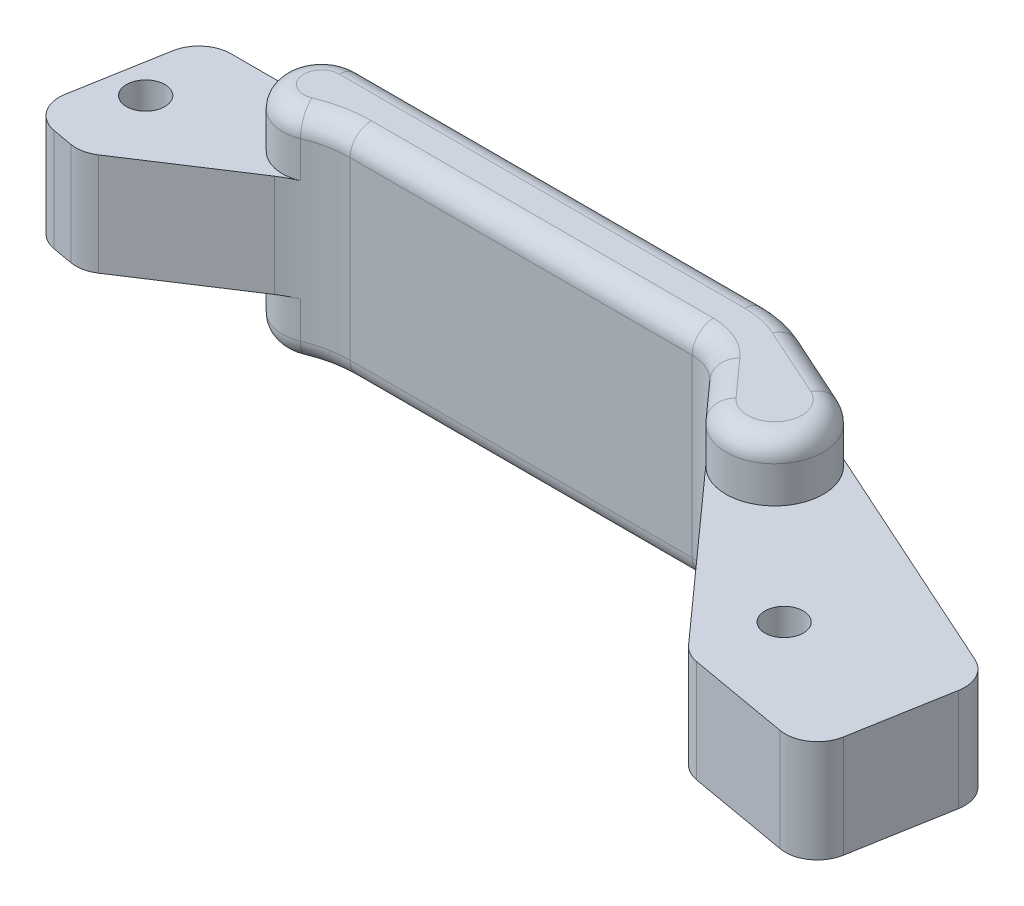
ISO-10303-21;
HEADER;
FILE_DESCRIPTION(('STEP AP214'),'2;1');
FILE_NAME('part.step','',(''),(''),'','','');
FILE_SCHEMA(('AUTOMOTIVE_DESIGN { 1 0 10303 214 1 1 1 1 }'));
ENDSEC;
DATA;
#1=APPLICATION_CONTEXT('core data for automotive mechanical design processes');
#2=APPLICATION_PROTOCOL_DEFINITION('international standard','automotive_design',2000,#1);
#3=PRODUCT_CONTEXT('',#1,'mechanical');
#4=PRODUCT('Part','Part','',(#3));
#5=PRODUCT_RELATED_PRODUCT_CATEGORY('part','',(#4));
#6=PRODUCT_DEFINITION_FORMATION('','',#4);
#7=PRODUCT_DEFINITION_CONTEXT('part definition',#1,'design');
#8=PRODUCT_DEFINITION('design','',#6,#7);
#9=PRODUCT_DEFINITION_SHAPE('','',#8);
#10=(LENGTH_UNIT() NAMED_UNIT(*) SI_UNIT(.MILLI.,.METRE.));
#11=(NAMED_UNIT(*) PLANE_ANGLE_UNIT() SI_UNIT($,.RADIAN.));
#12=(NAMED_UNIT(*) SI_UNIT($,.STERADIAN.) SOLID_ANGLE_UNIT());
#13=UNCERTAINTY_MEASURE_WITH_UNIT(LENGTH_MEASURE(1.E-05),#10,'distance_accuracy_value','');
#14=(GEOMETRIC_REPRESENTATION_CONTEXT(3) GLOBAL_UNCERTAINTY_ASSIGNED_CONTEXT((#13)) GLOBAL_UNIT_ASSIGNED_CONTEXT((#10,
#11,#12)) REPRESENTATION_CONTEXT('',''));
#15=CARTESIAN_POINT('',(0.,0.,0.));
#16=DIRECTION('',(0.,0.,1.));
#17=DIRECTION('',(1.,0.,0.));
#18=AXIS2_PLACEMENT_3D('',#15,#16,#17);
#19=CARTESIAN_POINT('',(8.72535178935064,-5.86916056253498,-0.177026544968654));
#20=DIRECTION('',(3.4198896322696E-13,-1.,-8.08462215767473E-13));
#21=DIRECTION('',(0.984807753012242,1.96405391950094E-13,0.173648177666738));
#22=AXIS2_PLACEMENT_3D('',#19,#20,#21);
#23=PLANE('',#22);
#24=CARTESIAN_POINT('',(-23.5052485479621,-5.86916056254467,-1.83304913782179));
#25=DIRECTION('',(3.4198896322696E-13,-1.,-8.08462215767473E-13));
#26=DIRECTION('',(0.984807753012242,1.96405391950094E-13,0.173648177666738));
#27=AXIS2_PLACEMENT_3D('',#24,#25,#26);
#28=CIRCLE('',#27,1.143);
#29=CARTESIAN_POINT('',(-24.6308838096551,-5.86916056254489,-2.03152900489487));
#30=VERTEX_POINT('',#29);
#31=EDGE_CURVE('E280',#30,#30,#28,.T.);
#32=ORIENTED_EDGE('',*,*,#31,.F.);
#33=EDGE_LOOP('',(#32));
#34=FACE_BOUND('',#33,.T.);
#35=DIRECTION('',(0.173648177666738,8.55565618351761E-13,-0.984807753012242));
#36=VECTOR('',#35,1.);
#37=CARTESIAN_POINT('',(-24.7280246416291,-5.86916056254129,-6.52702654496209));
#38=LINE('',#37,#36);
#39=CARTESIAN_POINT('',(-25.965251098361,-5.86916056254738,0.48963336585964));
#40=VERTEX_POINT('',#39);
#41=CARTESIAN_POINT('',(-25.0055986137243,-5.86916056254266,-4.95282632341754));
#42=VERTEX_POINT('',#41);
#43=EDGE_CURVE('E362',#40,#42,#38,.T.);
#44=ORIENTED_EDGE('',*,*,#43,.T.);
#45=CARTESIAN_POINT('',(-23.129539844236,-5.86916056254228,-4.62202654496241));
#46=DIRECTION('',(3.4198896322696E-13,-1.,-8.08462215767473E-13));
#47=DIRECTION('',(0.984807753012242,1.96405391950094E-13,0.173648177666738));
#48=AXIS2_PLACEMENT_3D('',#45,#46,#47);
#49=CIRCLE('',#48,1.905);
#50=CARTESIAN_POINT('',(-23.1295398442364,-5.86916056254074,-6.52702654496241));
#51=VERTEX_POINT('',#50);
#52=EDGE_CURVE('E441',#42,#51,#49,.T.);
#53=ORIENTED_EDGE('',*,*,#52,.T.);
#54=DIRECTION('',(1.,3.41988963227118E-13,-1.96009874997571E-13));
#55=VECTOR('',#54,1.);
#56=CARTESIAN_POINT('',(-24.7280246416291,-5.86916056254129,-6.52702654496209));
#57=LINE('',#56,#55);
#58=CARTESIAN_POINT('',(-15.4046482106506,-5.8691605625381,-6.52702654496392));
#59=VERTEX_POINT('',#58);
#60=EDGE_CURVE('E330',#51,#59,#57,.T.);
#61=ORIENTED_EDGE('',*,*,#60,.T.);
#62=CARTESIAN_POINT('',(-15.4046482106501,-5.86916056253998,-4.19729764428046));
#63=DIRECTION('',(3.4198896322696E-13,-1.,-8.08462215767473E-13));
#64=DIRECTION('',(0.984807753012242,1.96405391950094E-13,0.173648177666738));
#65=AXIS2_PLACEMENT_3D('',#62,#63,#64);
#66=CIRCLE('',#65,2.32972890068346);
#67=CARTESIAN_POINT('',(-14.5046226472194,-5.86916056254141,-2.04843963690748));
#68=VERTEX_POINT('',#67);
#69=EDGE_CURVE('E298',#59,#68,#66,.F.);
#70=ORIENTED_EDGE('',*,*,#69,.T.);
#71=CARTESIAN_POINT('',(-12.0514778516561,-5.86916056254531,3.80857159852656));
#72=DIRECTION('',(-3.4198896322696E-13,1.,8.08462215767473E-13));
#73=DIRECTION('',(-0.984807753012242,-1.96405391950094E-13,-0.173648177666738));
#74=AXIS2_PLACEMENT_3D('',#71,#72,#73);
#75=CIRCLE('',#74,6.35);
#76=CARTESIAN_POINT('',(-15.5257805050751,-5.8691605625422,-1.50666321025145));
#77=VERTEX_POINT('',#76);
#78=EDGE_CURVE('E351',#68,#77,#75,.T.);
#79=ORIENTED_EDGE('',*,*,#78,.T.);
#80=DIRECTION('',(-0.837044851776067,-7.28597490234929E-13,0.54713427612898));
#81=VECTOR('',#80,1.);
#82=CARTESIAN_POINT('',(-15.5257805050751,-5.8691605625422,-1.50666321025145));
#83=LINE('',#82,#81);
#84=CARTESIAN_POINT('',(-21.8486595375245,-5.8691605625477,2.62628598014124));
#85=VERTEX_POINT('',#84);
#86=EDGE_CURVE('E354',#77,#85,#83,.T.);
#87=ORIENTED_EDGE('',*,*,#86,.T.);
#88=CARTESIAN_POINT('',(-22.8909503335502,-5.86916056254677,1.03171553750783));
#89=DIRECTION('',(3.4198896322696E-13,-1.,-8.08462215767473E-13));
#90=DIRECTION('',(0.984807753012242,1.96405391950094E-13,0.173648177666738));
#91=AXIS2_PLACEMENT_3D('',#88,#89,#90);
#92=CIRCLE('',#91,1.905);
#93=CARTESIAN_POINT('',(-23.2217501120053,-5.8691605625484,2.90777430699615));
#94=VERTEX_POINT('',#93);
#95=EDGE_CURVE('E438',#85,#94,#92,.T.);
#96=ORIENTED_EDGE('',*,*,#95,.T.);
#97=DIRECTION('',(-0.984807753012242,-1.96405391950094E-13,-0.173648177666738));
#98=VECTOR('',#97,1.);
#99=CARTESIAN_POINT('',(-26.2960508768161,-5.86916056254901,2.36569213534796));
#100=LINE('',#99,#98);
#101=CARTESIAN_POINT('',(-24.4199921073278,-5.86916056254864,2.6964919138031));
#102=VERTEX_POINT('',#101);
#103=EDGE_CURVE('E358',#94,#102,#100,.T.);
#104=ORIENTED_EDGE('',*,*,#103,.T.);
#105=CARTESIAN_POINT('',(-24.0891923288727,-5.86916056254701,0.820433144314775));
#106=DIRECTION('',(3.4198896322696E-13,-1.,-8.08462215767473E-13));
#107=DIRECTION('',(0.984807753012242,1.96405391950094E-13,0.173648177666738));
#108=AXIS2_PLACEMENT_3D('',#105,#106,#107);
#109=CIRCLE('',#108,1.905);
#110=EDGE_CURVE('E435',#102,#40,#109,.T.);
#111=ORIENTED_EDGE('',*,*,#110,.T.);
#112=EDGE_LOOP('',(#44,#53,#61,#70,#79,#87,#96,#104,#111));
#113=FACE_BOUND('',#112,.T.);
#114=ADVANCED_FACE('F38',(#34,#113),#23,.T.);
#115=CARTESIAN_POINT('',(22.6207830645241,-5.86916056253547,6.30021474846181));
#116=DIRECTION('',(3.4198896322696E-13,-1.,-8.08462215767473E-13));
#117=DIRECTION('',(0.984807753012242,1.96405391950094E-13,0.173648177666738));
#118=AXIS2_PLACEMENT_3D('',#115,#116,#117);
#119=CIRCLE('',#118,1.143);
#120=CARTESIAN_POINT('',(21.4951478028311,-5.86916056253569,6.10173488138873));
#121=VERTEX_POINT('',#120);
#122=EDGE_CURVE('E316',#121,#121,#119,.T.);
#123=ORIENTED_EDGE('',*,*,#122,.F.);
#124=EDGE_LOOP('',(#123));
#125=FACE_BOUND('',#124,.T.);
#126=DIRECTION('',(-0.984807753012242,-1.96405391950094E-13,-0.173648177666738));
#127=VECTOR('',#126,1.);
#128=CARTESIAN_POINT('',(21.413184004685,-5.86916056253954,10.8329802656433));
#129=LINE('',#128,#127);
#130=CARTESIAN_POINT('',(28.1002829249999,-5.86916056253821,12.0120962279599));
#131=VERTEX_POINT('',#130);
#132=CARTESIAN_POINT('',(22.0622806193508,-5.86916056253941,10.9474335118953));
#133=VERTEX_POINT('',#132);
#134=EDGE_CURVE('E343',#131,#133,#129,.T.);
#135=ORIENTED_EDGE('',*,*,#134,.T.);
#136=CARTESIAN_POINT('',(22.3930803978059,-5.86916056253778,9.07137474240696));
#137=DIRECTION('',(3.4198896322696E-13,-1.,-8.08462215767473E-13));
#138=DIRECTION('',(0.984807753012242,1.96405391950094E-13,0.173648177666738));
#139=AXIS2_PLACEMENT_3D('',#136,#137,#138);
#140=CIRCLE('',#139,1.905);
#141=CARTESIAN_POINT('',(20.9736100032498,-5.8691605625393,10.3418584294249));
#142=VERTEX_POINT('',#141);
#143=EDGE_CURVE('E470',#133,#142,#140,.T.);
#144=ORIENTED_EDGE('',*,*,#143,.T.);
#145=DIRECTION('',(-0.66692057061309,3.74329019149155E-13,-0.745128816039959));
#146=VECTOR('',#145,1.);
#147=CARTESIAN_POINT('',(10.1997685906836,-5.86916056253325,-1.69540665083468));
#148=LINE('',#147,#146);
#149=CARTESIAN_POINT('',(12.1535594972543,-5.86916056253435,0.487500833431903));
#150=VERTEX_POINT('',#149);
#151=EDGE_CURVE('E347',#142,#150,#148,.T.);
#152=ORIENTED_EDGE('',*,*,#151,.T.);
#153=CARTESIAN_POINT('',(14.3125008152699,-5.86916056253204,-1.44483938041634));
#154=DIRECTION('',(3.4198896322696E-13,-1.,-8.08462215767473E-13));
#155=DIRECTION('',(0.984807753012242,1.96405391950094E-13,0.173648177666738));
#156=AXIS2_PLACEMENT_3D('',#153,#154,#155);
#157=CIRCLE('',#156,2.897406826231);
#158=CARTESIAN_POINT('',(15.5036192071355,-5.8691605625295,-4.08608970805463));
#159=VERTEX_POINT('',#158);
#160=EDGE_CURVE('E311',#150,#159,#157,.F.);
#161=ORIENTED_EDGE('',*,*,#160,.T.);
#162=DIRECTION('',(0.911591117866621,0.,0.411098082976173));
#163=VECTOR('',#162,1.);
#164=CARTESIAN_POINT('',(11.3358246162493,-5.86916056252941,-5.96563014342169));
#165=LINE('',#164,#163);
#166=CARTESIAN_POINT('',(30.2436675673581,-5.86916056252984,2.56119491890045));
#167=VERTEX_POINT('',#166);
#168=EDGE_CURVE('E334',#159,#167,#165,.T.);
#169=ORIENTED_EDGE('',*,*,#168,.T.);
#170=CARTESIAN_POINT('',(29.4605257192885,-5.86916056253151,4.29777599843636));
#171=DIRECTION('',(3.4198896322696E-13,-1.,-8.08462215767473E-13));
#172=DIRECTION('',(0.984807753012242,1.96405391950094E-13,0.173648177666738));
#173=AXIS2_PLACEMENT_3D('',#170,#171,#172);
#174=CIRCLE('',#173,1.905);
#175=CARTESIAN_POINT('',(31.3365844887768,-5.86916056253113,4.62857577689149));
#176=VERTEX_POINT('',#175);
#177=EDGE_CURVE('E467',#167,#176,#174,.T.);
#178=ORIENTED_EDGE('',*,*,#177,.T.);
#179=DIRECTION('',(-0.173648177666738,-8.55565618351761E-13,0.984807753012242));
#180=VECTOR('',#179,1.);
#181=CARTESIAN_POINT('',(29.9763416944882,-5.86916056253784,12.3428960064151));
#182=LINE('',#181,#180);
#183=CARTESIAN_POINT('',(30.3071414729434,-5.86916056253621,10.4668372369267));
#184=VERTEX_POINT('',#183);
#185=EDGE_CURVE('E339',#176,#184,#182,.T.);
#186=ORIENTED_EDGE('',*,*,#185,.T.);
#187=CARTESIAN_POINT('',(28.4310827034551,-5.86916056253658,10.1360374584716));
#188=DIRECTION('',(3.4198896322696E-13,-1.,-8.08462215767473E-13));
#189=DIRECTION('',(0.984807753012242,1.96405391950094E-13,0.173648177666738));
#190=AXIS2_PLACEMENT_3D('',#187,#188,#189);
#191=CIRCLE('',#190,1.905);
#192=EDGE_CURVE('E464',#184,#131,#191,.T.);
#193=ORIENTED_EDGE('',*,*,#192,.T.);
#194=EDGE_LOOP('',(#135,#144,#152,#161,#169,#178,#186,#193));
#195=FACE_BOUND('',#194,.T.);
#196=ADVANCED_FACE('F779',(#125,#195),#23,.T.);
#197=CARTESIAN_POINT('',(8.72535178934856,0.226839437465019,-0.177026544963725));
#198=DIRECTION('',(3.4198896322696E-13,-1.,-8.08462215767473E-13));
#199=DIRECTION('',(0.984807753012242,1.96405391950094E-13,0.173648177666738));
#200=AXIS2_PLACEMENT_3D('',#197,#198,#199);
#201=PLANE('',#200);
#202=CARTESIAN_POINT('',(-23.5052485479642,0.226839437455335,-1.83304913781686));
#203=DIRECTION('',(3.4198896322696E-13,-1.,-8.08462215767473E-13));
#204=DIRECTION('',(0.984807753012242,1.96405391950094E-13,0.173648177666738));
#205=AXIS2_PLACEMENT_3D('',#202,#203,#204);
#206=CIRCLE('',#205,1.143);
#207=CARTESIAN_POINT('',(-24.6308838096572,0.22683943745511,-2.03152900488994));
#208=VERTEX_POINT('',#207);
#209=EDGE_CURVE('E320',#208,#208,#206,.T.);
#210=ORIENTED_EDGE('',*,*,#209,.T.);
#211=EDGE_LOOP('',(#210));
#212=FACE_BOUND('',#211,.T.);
#213=DIRECTION('',(1.,3.41988963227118E-13,-1.96009874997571E-13));
#214=VECTOR('',#213,1.);
#215=CARTESIAN_POINT('',(-24.7280246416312,0.226839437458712,-6.52702654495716));
#216=LINE('',#215,#214);
#217=CARTESIAN_POINT('',(-23.1295398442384,0.226839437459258,-6.52702654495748));
#218=VERTEX_POINT('',#217);
#219=CARTESIAN_POINT('',(-15.4046482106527,0.2268394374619,-6.52702654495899));
#220=VERTEX_POINT('',#219);
#221=EDGE_CURVE('E268',#218,#220,#216,.T.);
#222=ORIENTED_EDGE('',*,*,#221,.F.);
#223=CARTESIAN_POINT('',(-23.1295398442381,0.226839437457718,-4.62202654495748));
#224=DIRECTION('',(3.4198896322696E-13,-1.,-8.08462215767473E-13));
#225=DIRECTION('',(0.984807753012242,1.96405391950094E-13,0.173648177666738));
#226=AXIS2_PLACEMENT_3D('',#223,#224,#225);
#227=CIRCLE('',#226,1.905);
#228=CARTESIAN_POINT('',(-25.0055986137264,0.226839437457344,-4.95282632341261));
#229=VERTEX_POINT('',#228);
#230=EDGE_CURVE('E425',#218,#229,#227,.F.);
#231=ORIENTED_EDGE('',*,*,#230,.T.);
#232=DIRECTION('',(0.173648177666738,8.55565618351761E-13,-0.984807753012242));
#233=VECTOR('',#232,1.);
#234=CARTESIAN_POINT('',(-24.7280246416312,0.226839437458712,-6.52702654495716));
#235=LINE('',#234,#233);
#236=CARTESIAN_POINT('',(-25.9652510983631,0.226839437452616,0.489633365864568));
#237=VERTEX_POINT('',#236);
#238=EDGE_CURVE('E335',#237,#229,#235,.T.);
#239=ORIENTED_EDGE('',*,*,#238,.F.);
#240=CARTESIAN_POINT('',(-24.0891923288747,0.22683943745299,0.820433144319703));
#241=DIRECTION('',(3.4198896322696E-13,-1.,-8.08462215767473E-13));
#242=DIRECTION('',(0.984807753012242,1.96405391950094E-13,0.173648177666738));
#243=AXIS2_PLACEMENT_3D('',#240,#241,#242);
#244=CIRCLE('',#243,1.905);
#245=CARTESIAN_POINT('',(-24.4199921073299,0.22683943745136,2.69649191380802));
#246=VERTEX_POINT('',#245);
#247=EDGE_CURVE('E419',#237,#246,#244,.F.);
#248=ORIENTED_EDGE('',*,*,#247,.T.);
#249=DIRECTION('',(-0.984807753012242,-1.96405391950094E-13,-0.173648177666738));
#250=VECTOR('',#249,1.);
#251=CARTESIAN_POINT('',(-26.2960508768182,0.226839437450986,2.36569213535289));
#252=LINE('',#251,#250);
#253=CARTESIAN_POINT('',(-23.2217501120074,0.226839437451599,2.90777430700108));
#254=VERTEX_POINT('',#253);
#255=EDGE_CURVE('E387',#254,#246,#252,.T.);
#256=ORIENTED_EDGE('',*,*,#255,.F.);
#257=CARTESIAN_POINT('',(-22.8909503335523,0.226839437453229,1.03171553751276));
#258=DIRECTION('',(3.4198896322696E-13,-1.,-8.08462215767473E-13));
#259=DIRECTION('',(0.984807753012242,1.96405391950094E-13,0.173648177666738));
#260=AXIS2_PLACEMENT_3D('',#257,#258,#259);
#261=CIRCLE('',#260,1.905);
#262=CARTESIAN_POINT('',(-21.8486595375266,0.226839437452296,2.62628598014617));
#263=VERTEX_POINT('',#262);
#264=EDGE_CURVE('E422',#254,#263,#261,.F.);
#265=ORIENTED_EDGE('',*,*,#264,.T.);
#266=DIRECTION('',(-0.837044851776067,-7.28597490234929E-13,0.54713427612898));
#267=VECTOR('',#266,1.);
#268=CARTESIAN_POINT('',(-15.5257805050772,0.2268394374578,-1.50666321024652));
#269=LINE('',#268,#267);
#270=CARTESIAN_POINT('',(-15.5257805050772,0.2268394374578,-1.50666321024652));
#271=VERTEX_POINT('',#270);
#272=EDGE_CURVE('E383',#271,#263,#269,.T.);
#273=ORIENTED_EDGE('',*,*,#272,.F.);
#274=CARTESIAN_POINT('',(-12.0514778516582,0.226839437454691,3.80857159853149));
#275=DIRECTION('',(-3.4198896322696E-13,1.,8.08462215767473E-13));
#276=DIRECTION('',(-0.984807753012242,-1.96405391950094E-13,-0.173648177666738));
#277=AXIS2_PLACEMENT_3D('',#274,#275,#276);
#278=CIRCLE('',#277,6.35);
#279=CARTESIAN_POINT('',(-14.5046226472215,0.226839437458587,-2.04843963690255));
#280=VERTEX_POINT('',#279);
#281=EDGE_CURVE('E296',#280,#271,#278,.T.);
#282=ORIENTED_EDGE('',*,*,#281,.F.);
#283=CARTESIAN_POINT('',(-15.4046482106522,0.226839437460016,-4.19729764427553));
#284=DIRECTION('',(3.4198896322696E-13,-1.,-8.08462215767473E-13));
#285=DIRECTION('',(0.984807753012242,1.96405391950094E-13,0.173648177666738));
#286=AXIS2_PLACEMENT_3D('',#283,#284,#285);
#287=CIRCLE('',#286,2.32972890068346);
#288=EDGE_CURVE('E285',#220,#280,#287,.F.);
#289=ORIENTED_EDGE('',*,*,#288,.F.);
#290=EDGE_LOOP('',(#222,#231,#239,#248,#256,#265,#273,#282,#289));
#291=FACE_BOUND('',#290,.T.);
#292=ADVANCED_FACE('F294',(#212,#291),#201,.F.);
#293=CARTESIAN_POINT('',(22.620783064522,0.226839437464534,6.30021474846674));
#294=DIRECTION('',(3.4198896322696E-13,-1.,-8.08462215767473E-13));
#295=DIRECTION('',(0.984807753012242,1.96405391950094E-13,0.173648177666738));
#296=AXIS2_PLACEMENT_3D('',#293,#294,#295);
#297=CIRCLE('',#296,1.143);
#298=CARTESIAN_POINT('',(21.495147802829,0.226839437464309,6.10173488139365));
#299=VERTEX_POINT('',#298);
#300=EDGE_CURVE('E315',#299,#299,#297,.T.);
#301=ORIENTED_EDGE('',*,*,#300,.T.);
#302=EDGE_LOOP('',(#301));
#303=FACE_BOUND('',#302,.T.);
#304=DIRECTION('',(-0.66692057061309,3.74329019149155E-13,-0.745128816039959));
#305=VECTOR('',#304,1.);
#306=CARTESIAN_POINT('',(10.1997685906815,0.22683943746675,-1.69540665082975));
#307=LINE('',#306,#305);
#308=CARTESIAN_POINT('',(20.9736100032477,0.226839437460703,10.3418584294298));
#309=VERTEX_POINT('',#308);
#310=CARTESIAN_POINT('',(12.1535594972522,0.226839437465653,0.487500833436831));
#311=VERTEX_POINT('',#310);
#312=EDGE_CURVE('E378',#309,#311,#307,.T.);
#313=ORIENTED_EDGE('',*,*,#312,.F.);
#314=CARTESIAN_POINT('',(22.3930803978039,0.226839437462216,9.07137474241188));
#315=DIRECTION('',(3.4198896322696E-13,-1.,-8.08462215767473E-13));
#316=DIRECTION('',(0.984807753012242,1.96405391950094E-13,0.173648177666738));
#317=AXIS2_PLACEMENT_3D('',#314,#315,#316);
#318=CIRCLE('',#317,1.905);
#319=CARTESIAN_POINT('',(22.0622806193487,0.226839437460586,10.9474335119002));
#320=VERTEX_POINT('',#319);
#321=EDGE_CURVE('E454',#309,#320,#318,.F.);
#322=ORIENTED_EDGE('',*,*,#321,.T.);
#323=DIRECTION('',(-0.984807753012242,-1.96405391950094E-13,-0.173648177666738));
#324=VECTOR('',#323,1.);
#325=CARTESIAN_POINT('',(21.4131840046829,0.226839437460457,10.8329802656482));
#326=LINE('',#325,#324);
#327=CARTESIAN_POINT('',(28.1002829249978,0.22683943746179,12.0120962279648));
#328=VERTEX_POINT('',#327);
#329=EDGE_CURVE('E374',#328,#320,#326,.T.);
#330=ORIENTED_EDGE('',*,*,#329,.F.);
#331=CARTESIAN_POINT('',(28.431082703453,0.22683943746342,10.1360374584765));
#332=DIRECTION('',(3.4198896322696E-13,-1.,-8.08462215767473E-13));
#333=DIRECTION('',(0.984807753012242,1.96405391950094E-13,0.173648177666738));
#334=AXIS2_PLACEMENT_3D('',#331,#332,#333);
#335=CIRCLE('',#334,1.905);
#336=CARTESIAN_POINT('',(30.3071414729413,0.226839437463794,10.4668372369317));
#337=VERTEX_POINT('',#336);
#338=EDGE_CURVE('E448',#328,#337,#335,.F.);
#339=ORIENTED_EDGE('',*,*,#338,.T.);
#340=DIRECTION('',(-0.173648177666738,-8.55565618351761E-13,0.984807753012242));
#341=VECTOR('',#340,1.);
#342=CARTESIAN_POINT('',(29.9763416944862,0.226839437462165,12.34289600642));
#343=LINE('',#342,#341);
#344=CARTESIAN_POINT('',(31.3365844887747,0.226839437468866,4.62857577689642));
#345=VERTEX_POINT('',#344);
#346=EDGE_CURVE('E370',#345,#337,#343,.T.);
#347=ORIENTED_EDGE('',*,*,#346,.F.);
#348=CARTESIAN_POINT('',(29.4605257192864,0.226839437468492,4.29777599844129));
#349=DIRECTION('',(3.4198896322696E-13,-1.,-8.08462215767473E-13));
#350=DIRECTION('',(0.984807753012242,1.96405391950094E-13,0.173648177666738));
#351=AXIS2_PLACEMENT_3D('',#348,#349,#350);
#352=CIRCLE('',#351,1.905);
#353=CARTESIAN_POINT('',(30.243667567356,0.226839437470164,2.56119491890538));
#354=VERTEX_POINT('',#353);
#355=EDGE_CURVE('E451',#345,#354,#352,.F.);
#356=ORIENTED_EDGE('',*,*,#355,.T.);
#357=DIRECTION('',(0.911591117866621,0.,0.411098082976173));
#358=VECTOR('',#357,1.);
#359=CARTESIAN_POINT('',(11.3358246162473,0.226839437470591,-5.96563014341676));
#360=LINE('',#359,#358);
#361=CARTESIAN_POINT('',(15.5036192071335,0.226839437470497,-4.0860897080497));
#362=VERTEX_POINT('',#361);
#363=EDGE_CURVE('E279',#362,#354,#360,.T.);
#364=ORIENTED_EDGE('',*,*,#363,.F.);
#365=CARTESIAN_POINT('',(14.3125008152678,0.226839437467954,-1.44483938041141));
#366=DIRECTION('',(3.4198896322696E-13,-1.,-8.08462215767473E-13));
#367=DIRECTION('',(0.984807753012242,1.96405391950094E-13,0.173648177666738));
#368=AXIS2_PLACEMENT_3D('',#365,#366,#367);
#369=CIRCLE('',#368,2.897406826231);
#370=EDGE_CURVE('E304',#311,#362,#369,.F.);
#371=ORIENTED_EDGE('',*,*,#370,.F.);
#372=EDGE_LOOP('',(#313,#322,#330,#339,#347,#356,#364,#371));
#373=FACE_BOUND('',#372,.T.);
#374=ADVANCED_FACE('F792',(#303,#373),#201,.F.);
#375=CARTESIAN_POINT('',(-24.7280246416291,-5.86916056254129,-6.52702654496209));
#376=DIRECTION('',(1.96009874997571E-13,-8.08462215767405E-13,1.));
#377=DIRECTION('',(-1.,-3.41988963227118E-13,1.96009874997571E-13));
#378=AXIS2_PLACEMENT_3D('',#375,#376,#377);
#379=PLANE('',#378);
#380=DIRECTION('',(-3.4198896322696E-13,1.,8.08462215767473E-13));
#381=VECTOR('',#380,1.);
#382=CARTESIAN_POINT('',(-15.4046482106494,-9.3108605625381,-6.5270265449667));
#383=LINE('',#382,#381);
#384=CARTESIAN_POINT('',(-15.4046482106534,2.3985394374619,-6.52702654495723));
#385=VERTEX_POINT('',#384);
#386=EDGE_CURVE('E271',#220,#385,#383,.T.);
#387=ORIENTED_EDGE('',*,*,#386,.T.);
#388=DIRECTION('',(1.,3.41988963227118E-13,-1.96009874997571E-13));
#389=VECTOR('',#388,1.);
#390=CARTESIAN_POINT('',(-24.7280246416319,2.39853943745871,-6.52702654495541));
#391=LINE('',#390,#389);
#392=CARTESIAN_POINT('',(8.72535178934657,2.39853943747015,-6.52702654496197));
#393=VERTEX_POINT('',#392);
#394=EDGE_CURVE('E553',#385,#393,#391,.T.);
#395=ORIENTED_EDGE('',*,*,#394,.T.);
#396=DIRECTION('',(-3.4198896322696E-13,1.,8.08462215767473E-13));
#397=VECTOR('',#396,1.);
#398=CARTESIAN_POINT('',(8.72535178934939,-5.86916056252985,-6.52702654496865));
#399=LINE('',#398,#397);
#400=CARTESIAN_POINT('',(8.72535178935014,-8.04086056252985,-6.52702654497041));
#401=VERTEX_POINT('',#400);
#402=EDGE_CURVE('E413',#401,#393,#399,.T.);
#403=ORIENTED_EDGE('',*,*,#402,.F.);
#404=DIRECTION('',(1.,3.41988963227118E-13,-1.96009874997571E-13));
#405=VECTOR('',#404,1.);
#406=CARTESIAN_POINT('',(-15.4046482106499,-8.0408605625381,-6.52702654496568));
#407=LINE('',#406,#405);
#408=CARTESIAN_POINT('',(-15.4046482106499,-8.0408605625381,-6.52702654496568));
#409=VERTEX_POINT('',#408);
#410=EDGE_CURVE('E550',#401,#409,#407,.F.);
#411=ORIENTED_EDGE('',*,*,#410,.T.);
#412=EDGE_CURVE('E290',#409,#59,#383,.T.);
#413=ORIENTED_EDGE('',*,*,#412,.T.);
#414=ORIENTED_EDGE('',*,*,#60,.F.);
#415=DIRECTION('',(-3.4198896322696E-13,1.,8.08462215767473E-13));
#416=VECTOR('',#415,1.);
#417=CARTESIAN_POINT('',(-23.1295398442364,-5.86916056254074,-6.52702654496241));
#418=LINE('',#417,#416);
#419=EDGE_CURVE('E275',#51,#218,#418,.T.);
#420=ORIENTED_EDGE('',*,*,#419,.T.);
#421=ORIENTED_EDGE('',*,*,#221,.T.);
#422=EDGE_LOOP('',(#387,#395,#403,#411,#413,#414,#420,#421));
#423=FACE_BOUND('',#422,.T.);
#424=ADVANCED_FACE('F270',(#423),#379,.F.);
#425=CARTESIAN_POINT('',(8.72535178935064,-5.86916056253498,-0.177026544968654));
#426=DIRECTION('',(-3.4198896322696E-13,1.,8.08462215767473E-13));
#427=DIRECTION('',(-0.984807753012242,-1.96405391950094E-13,-0.173648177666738));
#428=AXIS2_PLACEMENT_3D('',#425,#426,#427);
#429=CYLINDRICAL_SURFACE('',#428,6.35);
#430=ORIENTED_EDGE('',*,*,#402,.T.);
#431=CARTESIAN_POINT('',(8.72535178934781,2.39853943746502,-0.17702654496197));
#432=DIRECTION('',(3.4198896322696E-13,-1.,-8.08462215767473E-13));
#433=DIRECTION('',(0.984807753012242,1.96405391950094E-13,0.173648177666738));
#434=AXIS2_PLACEMENT_3D('',#431,#432,#433);
#435=CIRCLE('',#434,6.35);
#436=CARTESIAN_POINT('',(11.3358246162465,2.39853943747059,-5.96563014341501));
#437=VERTEX_POINT('',#436);
#438=EDGE_CURVE('E547',#393,#437,#435,.T.);
#439=ORIENTED_EDGE('',*,*,#438,.T.);
#440=DIRECTION('',(-3.4198896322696E-13,1.,8.08462215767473E-13));
#441=VECTOR('',#440,1.);
#442=CARTESIAN_POINT('',(11.3358246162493,-5.86916056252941,-5.96563014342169));
#443=LINE('',#442,#441);
#444=CARTESIAN_POINT('',(11.3358246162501,-8.04086056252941,-5.96563014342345));
#445=VERTEX_POINT('',#444);
#446=EDGE_CURVE('E409',#445,#437,#443,.T.);
#447=ORIENTED_EDGE('',*,*,#446,.F.);
#448=CARTESIAN_POINT('',(8.72535178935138,-8.04086056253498,-0.177026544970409));
#449=DIRECTION('',(3.4198896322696E-13,-1.,-8.08462215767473E-13));
#450=DIRECTION('',(0.984807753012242,1.96405391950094E-13,0.173648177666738));
#451=AXIS2_PLACEMENT_3D('',#448,#449,#450);
#452=CIRCLE('',#451,6.35);
#453=EDGE_CURVE('E544',#445,#401,#452,.F.);
#454=ORIENTED_EDGE('',*,*,#453,.T.);
#455=EDGE_LOOP('',(#430,#439,#447,#454));
#456=FACE_BOUND('',#455,.T.);
#457=ADVANCED_FACE('F732',(#456),#429,.T.);
#458=CARTESIAN_POINT('',(11.3358246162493,-5.86916056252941,-5.96563014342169));
#459=DIRECTION('',(-0.411098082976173,-8.77577982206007E-13,0.911591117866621));
#460=DIRECTION('',(-0.911591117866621,0.,-0.411098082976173));
#461=AXIS2_PLACEMENT_3D('',#458,#459,#460);
#462=PLANE('',#461);
#463=ORIENTED_EDGE('',*,*,#446,.T.);
#464=DIRECTION('',(0.911591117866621,0.,0.411098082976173));
#465=VECTOR('',#464,1.);
#466=CARTESIAN_POINT('',(11.3358246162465,2.39853943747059,-5.96563014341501));
#467=LINE('',#466,#465);
#468=CARTESIAN_POINT('',(15.5036192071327,2.3985394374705,-4.08608970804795));
#469=VERTEX_POINT('',#468);
#470=EDGE_CURVE('E541',#437,#469,#467,.T.);
#471=ORIENTED_EDGE('',*,*,#470,.T.);
#472=DIRECTION('',(-3.4198896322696E-13,1.,8.08462215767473E-13));
#473=VECTOR('',#472,1.);
#474=CARTESIAN_POINT('',(15.5036192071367,-9.3108605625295,-4.08608970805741));
#475=LINE('',#474,#473);
#476=EDGE_CURVE('E748',#362,#469,#475,.T.);
#477=ORIENTED_EDGE('',*,*,#476,.F.);
#478=ORIENTED_EDGE('',*,*,#363,.T.);
#479=DIRECTION('',(-3.4198896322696E-13,1.,8.08462215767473E-13));
#480=VECTOR('',#479,1.);
#481=CARTESIAN_POINT('',(30.2436675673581,-5.86916056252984,2.56119491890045));
#482=LINE('',#481,#480);
#483=EDGE_CURVE('E480',#354,#167,#482,.F.);
#484=ORIENTED_EDGE('',*,*,#483,.T.);
#485=ORIENTED_EDGE('',*,*,#168,.F.);
#486=CARTESIAN_POINT('',(15.5036192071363,-8.0408605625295,-4.08608970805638));
#487=VERTEX_POINT('',#486);
#488=EDGE_CURVE('E291',#487,#159,#475,.T.);
#489=ORIENTED_EDGE('',*,*,#488,.F.);
#490=DIRECTION('',(0.911591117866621,0.,0.411098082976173));
#491=VECTOR('',#490,1.);
#492=CARTESIAN_POINT('',(11.3358246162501,-8.04086056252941,-5.96563014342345));
#493=LINE('',#492,#491);
#494=EDGE_CURVE('E538',#487,#445,#493,.F.);
#495=ORIENTED_EDGE('',*,*,#494,.T.);
#496=EDGE_LOOP('',(#463,#471,#477,#478,#484,#485,#489,#495));
#497=FACE_BOUND('',#496,.T.);
#498=ADVANCED_FACE('F747',(#497),#462,.F.);
#499=CARTESIAN_POINT('',(29.9763416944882,-5.86916056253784,12.3428960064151));
#500=DIRECTION('',(-0.984807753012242,-1.96405391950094E-13,-0.173648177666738));
#501=DIRECTION('',(3.4198896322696E-13,-1.,-8.08462215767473E-13));
#502=AXIS2_PLACEMENT_3D('',#499,#500,#501);
#503=PLANE('',#502);
#504=ORIENTED_EDGE('',*,*,#185,.F.);
#505=DIRECTION('',(-3.4198896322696E-13,1.,8.08462215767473E-13));
#506=VECTOR('',#505,1.);
#507=CARTESIAN_POINT('',(31.3365844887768,-5.86916056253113,4.62857577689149));
#508=LINE('',#507,#506);
#509=EDGE_CURVE('E476',#176,#345,#508,.T.);
#510=ORIENTED_EDGE('',*,*,#509,.T.);
#511=ORIENTED_EDGE('',*,*,#346,.T.);
#512=DIRECTION('',(-3.4198896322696E-13,1.,8.08462215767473E-13));
#513=VECTOR('',#512,1.);
#514=CARTESIAN_POINT('',(30.3071414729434,-5.86916056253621,10.4668372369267));
#515=LINE('',#514,#513);
#516=EDGE_CURVE('E473',#337,#184,#515,.F.);
#517=ORIENTED_EDGE('',*,*,#516,.T.);
#518=EDGE_LOOP('',(#504,#510,#511,#517));
#519=FACE_BOUND('',#518,.T.);
#520=ADVANCED_FACE('F819',(#519),#503,.F.);
#521=CARTESIAN_POINT('',(21.413184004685,-5.86916056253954,10.8329802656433));
#522=DIRECTION('',(0.173648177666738,8.55565618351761E-13,-0.984807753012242));
#523=DIRECTION('',(0.984807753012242,1.96405391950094E-13,0.173648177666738));
#524=AXIS2_PLACEMENT_3D('',#521,#522,#523);
#525=PLANE('',#524);
#526=ORIENTED_EDGE('',*,*,#329,.T.);
#527=DIRECTION('',(-3.4198896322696E-13,1.,8.08462215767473E-13));
#528=VECTOR('',#527,1.);
#529=CARTESIAN_POINT('',(22.0622806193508,-5.86916056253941,10.9474335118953));
#530=LINE('',#529,#528);
#531=EDGE_CURVE('E461',#320,#133,#530,.F.);
#532=ORIENTED_EDGE('',*,*,#531,.T.);
#533=ORIENTED_EDGE('',*,*,#134,.F.);
#534=DIRECTION('',(-3.4198896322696E-13,1.,8.08462215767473E-13));
#535=VECTOR('',#534,1.);
#536=CARTESIAN_POINT('',(28.1002829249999,-5.86916056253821,12.0120962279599));
#537=LINE('',#536,#535);
#538=EDGE_CURVE('E457',#131,#328,#537,.T.);
#539=ORIENTED_EDGE('',*,*,#538,.T.);
#540=EDGE_LOOP('',(#526,#532,#533,#539));
#541=FACE_BOUND('',#540,.T.);
#542=ADVANCED_FACE('F815',(#541),#525,.F.);
#543=CARTESIAN_POINT('',(10.1997685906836,-5.86916056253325,-1.69540665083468));
#544=DIRECTION('',(0.745128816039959,7.94005913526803E-13,-0.66692057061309));
#545=DIRECTION('',(0.66692057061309,-3.74329019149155E-13,0.745128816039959));
#546=AXIS2_PLACEMENT_3D('',#543,#544,#545);
#547=PLANE('',#546);
#548=DIRECTION('',(-3.4198896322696E-13,1.,8.08462215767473E-13));
#549=VECTOR('',#548,1.);
#550=CARTESIAN_POINT('',(12.1535594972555,-9.31086056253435,0.48750083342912));
#551=LINE('',#550,#549);
#552=CARTESIAN_POINT('',(12.1535594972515,2.39853943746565,0.487500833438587));
#553=VERTEX_POINT('',#552);
#554=EDGE_CURVE('E631',#311,#553,#551,.T.);
#555=ORIENTED_EDGE('',*,*,#554,.T.);
#556=DIRECTION('',(-0.66692057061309,3.74329019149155E-13,-0.745128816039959));
#557=VECTOR('',#556,1.);
#558=CARTESIAN_POINT('',(10.1997685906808,2.39853943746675,-1.695406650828));
#559=LINE('',#558,#557);
#560=CARTESIAN_POINT('',(10.1997685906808,2.39853943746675,-1.695406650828));
#561=VERTEX_POINT('',#560);
#562=EDGE_CURVE('E532',#553,#561,#559,.T.);
#563=ORIENTED_EDGE('',*,*,#562,.T.);
#564=DIRECTION('',(-3.4198896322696E-13,1.,8.08462215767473E-13));
#565=VECTOR('',#564,1.);
#566=CARTESIAN_POINT('',(10.1997685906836,-5.86916056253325,-1.69540665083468));
#567=LINE('',#566,#565);
#568=CARTESIAN_POINT('',(10.1997685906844,-8.04086056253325,-1.69540665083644));
#569=VERTEX_POINT('',#568);
#570=EDGE_CURVE('E405',#569,#561,#567,.T.);
#571=ORIENTED_EDGE('',*,*,#570,.F.);
#572=DIRECTION('',(-0.66692057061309,3.74329019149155E-13,-0.745128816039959));
#573=VECTOR('',#572,1.);
#574=CARTESIAN_POINT('',(12.153559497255,-8.04086056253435,0.487500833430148));
#575=LINE('',#574,#573);
#576=CARTESIAN_POINT('',(12.153559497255,-8.04086056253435,0.487500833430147));
#577=VERTEX_POINT('',#576);
#578=EDGE_CURVE('E529',#569,#577,#575,.F.);
#579=ORIENTED_EDGE('',*,*,#578,.T.);
#580=EDGE_CURVE('E756',#577,#150,#551,.T.);
#581=ORIENTED_EDGE('',*,*,#580,.T.);
#582=ORIENTED_EDGE('',*,*,#151,.F.);
#583=DIRECTION('',(-3.4198896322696E-13,1.,8.08462215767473E-13));
#584=VECTOR('',#583,1.);
#585=CARTESIAN_POINT('',(20.9736100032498,-5.8691605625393,10.3418584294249));
#586=LINE('',#585,#584);
#587=EDGE_CURVE('E444',#142,#309,#586,.T.);
#588=ORIENTED_EDGE('',*,*,#587,.T.);
#589=ORIENTED_EDGE('',*,*,#312,.T.);
#590=EDGE_LOOP('',(#555,#563,#571,#579,#581,#582,#588,#589));
#591=FACE_BOUND('',#590,.T.);
#592=ADVANCED_FACE('F812',(#591),#547,.F.);
#593=CARTESIAN_POINT('',(8.30714139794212,-5.86916056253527,-0.00142840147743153));
#594=DIRECTION('',(-3.4198896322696E-13,1.,8.08462215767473E-13));
#595=DIRECTION('',(-0.984807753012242,-1.96405391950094E-13,-0.173648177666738));
#596=AXIS2_PLACEMENT_3D('',#593,#594,#595);
#597=CYLINDRICAL_SURFACE('',#596,2.54);
#598=ORIENTED_EDGE('',*,*,#570,.T.);
#599=CARTESIAN_POINT('',(8.30714139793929,2.39853943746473,-0.00142840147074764));
#600=DIRECTION('',(3.4198896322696E-13,-1.,-8.08462215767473E-13));
#601=DIRECTION('',(0.984807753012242,1.96405391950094E-13,0.173648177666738));
#602=AXIS2_PLACEMENT_3D('',#599,#600,#601);
#603=CIRCLE('',#602,2.54);
#604=CARTESIAN_POINT('',(8.30714139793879,2.39853943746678,-2.54142840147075));
#605=VERTEX_POINT('',#604);
#606=EDGE_CURVE('E497',#561,#605,#603,.F.);
#607=ORIENTED_EDGE('',*,*,#606,.T.);
#608=DIRECTION('',(-3.4198896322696E-13,1.,8.08462215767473E-13));
#609=VECTOR('',#608,1.);
#610=CARTESIAN_POINT('',(8.30714139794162,-5.86916056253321,-2.54142840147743));
#611=LINE('',#610,#609);
#612=CARTESIAN_POINT('',(8.30714139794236,-8.04086056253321,-2.54142840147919));
#613=VERTEX_POINT('',#612);
#614=EDGE_CURVE('E401',#613,#605,#611,.T.);
#615=ORIENTED_EDGE('',*,*,#614,.F.);
#616=CARTESIAN_POINT('',(8.30714139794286,-8.04086056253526,-0.00142840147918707));
#617=DIRECTION('',(3.4198896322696E-13,-1.,-8.08462215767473E-13));
#618=DIRECTION('',(0.984807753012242,1.96405391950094E-13,0.173648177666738));
#619=AXIS2_PLACEMENT_3D('',#616,#617,#618);
#620=CIRCLE('',#619,2.54);
#621=EDGE_CURVE('E493',#613,#569,#620,.T.);
#622=ORIENTED_EDGE('',*,*,#621,.T.);
#623=EDGE_LOOP('',(#598,#607,#615,#622));
#624=FACE_BOUND('',#623,.T.);
#625=ADVANCED_FACE('F705',(#624),#597,.F.);
#626=CARTESIAN_POINT('',(8.30714139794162,-5.86916056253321,-2.54142840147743));
#627=DIRECTION('',(-1.96093141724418E-13,8.08462215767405E-13,-1.));
#628=DIRECTION('',(1.,3.41988963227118E-13,-1.96093141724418E-13));
#629=AXIS2_PLACEMENT_3D('',#626,#627,#628);
#630=PLANE('',#629);
#631=ORIENTED_EDGE('',*,*,#614,.T.);
#632=DIRECTION('',(-1.,-3.41988963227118E-13,1.96093141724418E-13));
#633=VECTOR('',#632,1.);
#634=CARTESIAN_POINT('',(8.30714139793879,2.39853943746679,-2.54142840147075));
#635=LINE('',#634,#633);
#636=CARTESIAN_POINT('',(-12.0514778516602,2.39853943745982,-2.54142840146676));
#637=VERTEX_POINT('',#636);
#638=EDGE_CURVE('E11',#605,#637,#635,.T.);
#639=ORIENTED_EDGE('',*,*,#638,.T.);
#640=DIRECTION('',(-3.4198896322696E-13,1.,8.08462215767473E-13));
#641=VECTOR('',#640,1.);
#642=CARTESIAN_POINT('',(-12.0514778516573,-5.86916056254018,-2.54142840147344));
#643=LINE('',#642,#641);
#644=CARTESIAN_POINT('',(-12.0514778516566,-8.04086056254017,-2.5414284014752));
#645=VERTEX_POINT('',#644);
#646=EDGE_CURVE('E397',#645,#637,#643,.T.);
#647=ORIENTED_EDGE('',*,*,#646,.F.);
#648=DIRECTION('',(-1.,-3.41988963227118E-13,1.96093141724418E-13));
#649=VECTOR('',#648,1.);
#650=CARTESIAN_POINT('',(8.30714139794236,-8.04086056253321,-2.54142840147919));
#651=LINE('',#650,#649);
#652=EDGE_CURVE('E48',#645,#613,#651,.F.);
#653=ORIENTED_EDGE('',*,*,#652,.T.);
#654=EDGE_LOOP('',(#631,#639,#647,#653));
#655=FACE_BOUND('',#654,.T.);
#656=ADVANCED_FACE('F695',(#655),#630,.F.);
#657=CARTESIAN_POINT('',(-12.0514778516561,-5.86916056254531,3.80857159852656));
#658=DIRECTION('',(-3.4198896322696E-13,1.,8.08462215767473E-13));
#659=DIRECTION('',(-0.984807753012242,-1.96405391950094E-13,-0.173648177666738));
#660=AXIS2_PLACEMENT_3D('',#657,#658,#659);
#661=CYLINDRICAL_SURFACE('',#660,6.35);
#662=ORIENTED_EDGE('',*,*,#646,.T.);
#663=CARTESIAN_POINT('',(-12.0514778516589,2.39853943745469,3.80857159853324));
#664=DIRECTION('',(3.4198896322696E-13,-1.,-8.08462215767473E-13));
#665=DIRECTION('',(0.984807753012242,1.96405391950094E-13,0.173648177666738));
#666=AXIS2_PLACEMENT_3D('',#663,#664,#665);
#667=CIRCLE('',#666,6.35);
#668=CARTESIAN_POINT('',(-14.5046226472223,2.39853943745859,-2.0484396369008));
#669=VERTEX_POINT('',#668);
#670=EDGE_CURVE('E561',#637,#669,#667,.F.);
#671=ORIENTED_EDGE('',*,*,#670,.T.);
#672=DIRECTION('',(-3.4198896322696E-13,1.,8.08462215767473E-13));
#673=VECTOR('',#672,1.);
#674=CARTESIAN_POINT('',(-14.5046226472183,-9.31086056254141,-2.04843963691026));
#675=LINE('',#674,#673);
#676=EDGE_CURVE('E306',#280,#669,#675,.T.);
#677=ORIENTED_EDGE('',*,*,#676,.F.);
#678=ORIENTED_EDGE('',*,*,#281,.T.);
#679=DIRECTION('',(-3.4198896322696E-13,1.,8.08462215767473E-13));
#680=VECTOR('',#679,1.);
#681=CARTESIAN_POINT('',(-15.5257805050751,-5.8691605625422,-1.50666321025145));
#682=LINE('',#681,#680);
#683=EDGE_CURVE('E365',#77,#271,#682,.T.);
#684=ORIENTED_EDGE('',*,*,#683,.F.);
#685=ORIENTED_EDGE('',*,*,#78,.F.);
#686=CARTESIAN_POINT('',(-14.5046226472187,-8.04086056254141,-2.04843963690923));
#687=VERTEX_POINT('',#686);
#688=EDGE_CURVE('E299',#687,#68,#675,.T.);
#689=ORIENTED_EDGE('',*,*,#688,.F.);
#690=CARTESIAN_POINT('',(-12.0514778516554,-8.04086056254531,3.8085715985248));
#691=DIRECTION('',(3.4198896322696E-13,-1.,-8.08462215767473E-13));
#692=DIRECTION('',(0.984807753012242,1.96405391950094E-13,0.173648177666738));
#693=AXIS2_PLACEMENT_3D('',#690,#691,#692);
#694=CIRCLE('',#693,6.35);
#695=EDGE_CURVE('E558',#687,#645,#694,.T.);
#696=ORIENTED_EDGE('',*,*,#695,.T.);
#697=EDGE_LOOP('',(#662,#671,#677,#678,#684,#685,#689,#696));
#698=FACE_BOUND('',#697,.T.);
#699=ADVANCED_FACE('F691',(#698),#661,.F.);
#700=CARTESIAN_POINT('',(-15.5257805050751,-5.8691605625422,-1.50666321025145));
#701=DIRECTION('',(-0.54713427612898,4.89605251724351E-13,-0.837044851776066));
#702=DIRECTION('',(0.837044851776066,7.28597490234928E-13,-0.54713427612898));
#703=AXIS2_PLACEMENT_3D('',#700,#701,#702);
#704=PLANE('',#703);
#705=ORIENTED_EDGE('',*,*,#272,.T.);
#706=DIRECTION('',(-3.4198896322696E-13,1.,8.08462215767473E-13));
#707=VECTOR('',#706,1.);
#708=CARTESIAN_POINT('',(-21.8486595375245,-5.8691605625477,2.62628598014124));
#709=LINE('',#708,#707);
#710=EDGE_CURVE('E490',#263,#85,#709,.F.);
#711=ORIENTED_EDGE('',*,*,#710,.T.);
#712=ORIENTED_EDGE('',*,*,#86,.F.);
#713=ORIENTED_EDGE('',*,*,#683,.T.);
#714=EDGE_LOOP('',(#705,#711,#712,#713));
#715=FACE_BOUND('',#714,.T.);
#716=ADVANCED_FACE('F801',(#715),#704,.F.);
#717=CARTESIAN_POINT('',(-26.2960508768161,-5.86916056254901,2.36569213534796));
#718=DIRECTION('',(0.173648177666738,8.55565618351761E-13,-0.984807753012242));
#719=DIRECTION('',(-3.4198896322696E-13,1.,8.08462215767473E-13));
#720=AXIS2_PLACEMENT_3D('',#717,#718,#719);
#721=PLANE('',#720);
#722=ORIENTED_EDGE('',*,*,#103,.F.);
#723=DIRECTION('',(-3.4198896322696E-13,1.,8.08462215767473E-13));
#724=VECTOR('',#723,1.);
#725=CARTESIAN_POINT('',(-23.2217501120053,-5.8691605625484,2.90777430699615));
#726=LINE('',#725,#724);
#727=EDGE_CURVE('E486',#94,#254,#726,.T.);
#728=ORIENTED_EDGE('',*,*,#727,.T.);
#729=ORIENTED_EDGE('',*,*,#255,.T.);
#730=DIRECTION('',(-3.4198896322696E-13,1.,8.08462215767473E-13));
#731=VECTOR('',#730,1.);
#732=CARTESIAN_POINT('',(-24.4199921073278,-5.86916056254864,2.6964919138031));
#733=LINE('',#732,#731);
#734=EDGE_CURVE('E483',#246,#102,#733,.F.);
#735=ORIENTED_EDGE('',*,*,#734,.T.);
#736=EDGE_LOOP('',(#722,#728,#729,#735));
#737=FACE_BOUND('',#736,.T.);
#738=ADVANCED_FACE('F797',(#737),#721,.F.);
#739=CARTESIAN_POINT('',(-24.7280246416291,-5.86916056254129,-6.52702654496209));
#740=DIRECTION('',(0.984807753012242,1.96405391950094E-13,0.173648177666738));
#741=DIRECTION('',(-3.4198896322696E-13,1.,8.08462215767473E-13));
#742=AXIS2_PLACEMENT_3D('',#739,#740,#741);
#743=PLANE('',#742);
#744=ORIENTED_EDGE('',*,*,#238,.T.);
#745=DIRECTION('',(-3.4198896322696E-13,1.,8.08462215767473E-13));
#746=VECTOR('',#745,1.);
#747=CARTESIAN_POINT('',(-25.0055986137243,-5.86916056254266,-4.95282632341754));
#748=LINE('',#747,#746);
#749=EDGE_CURVE('E432',#229,#42,#748,.F.);
#750=ORIENTED_EDGE('',*,*,#749,.T.);
#751=ORIENTED_EDGE('',*,*,#43,.F.);
#752=DIRECTION('',(-3.4198896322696E-13,1.,8.08462215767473E-13));
#753=VECTOR('',#752,1.);
#754=CARTESIAN_POINT('',(-25.965251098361,-5.86916056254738,0.48963336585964));
#755=LINE('',#754,#753);
#756=EDGE_CURVE('E428',#40,#237,#755,.T.);
#757=ORIENTED_EDGE('',*,*,#756,.T.);
#758=EDGE_LOOP('',(#744,#750,#751,#757));
#759=FACE_BOUND('',#758,.T.);
#760=ADVANCED_FACE('F794',(#759),#743,.F.);
#761=CARTESIAN_POINT('',(-23.5052485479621,-5.86916056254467,-1.83304913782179));
#762=DIRECTION('',(-3.4198896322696E-13,1.,8.08462215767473E-13));
#763=DIRECTION('',(-0.984807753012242,-1.96405391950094E-13,-0.173648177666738));
#764=AXIS2_PLACEMENT_3D('',#761,#762,#763);
#765=CYLINDRICAL_SURFACE('',#764,1.143);
#766=CARTESIAN_POINT('',(-24.6308838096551,-5.86916056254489,-2.03152900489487));
#767=CARTESIAN_POINT('',(-24.6308838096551,-5.80566056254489,-2.03152900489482));
#768=CARTESIAN_POINT('',(-24.6308838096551,-5.74216056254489,-2.03152900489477));
#769=CARTESIAN_POINT('',(-24.6308838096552,-5.61516056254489,-2.03152900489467));
#770=CARTESIAN_POINT('',(-24.6308838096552,-5.55166056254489,-2.03152900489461));
#771=CARTESIAN_POINT('',(-24.6308838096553,-5.42466056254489,-2.03152900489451));
#772=CARTESIAN_POINT('',(-24.6308838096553,-5.36116056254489,-2.03152900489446));
#773=CARTESIAN_POINT('',(-24.6308838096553,-5.23416056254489,-2.03152900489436));
#774=CARTESIAN_POINT('',(-24.6308838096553,-5.17066056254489,-2.03152900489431));
#775=CARTESIAN_POINT('',(-24.6308838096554,-5.04366056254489,-2.0315290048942));
#776=CARTESIAN_POINT('',(-24.6308838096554,-4.98016056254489,-2.03152900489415));
#777=CARTESIAN_POINT('',(-24.6308838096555,-4.85316056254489,-2.03152900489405));
#778=CARTESIAN_POINT('',(-24.6308838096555,-4.78966056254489,-2.031529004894));
#779=CARTESIAN_POINT('',(-24.6308838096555,-4.66266056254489,-2.0315290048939));
#780=CARTESIAN_POINT('',(-24.6308838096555,-4.59916056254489,-2.03152900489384));
#781=CARTESIAN_POINT('',(-24.6308838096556,-4.47216056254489,-2.03152900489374));
#782=CARTESIAN_POINT('',(-24.6308838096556,-4.40866056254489,-2.03152900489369));
#783=CARTESIAN_POINT('',(-24.6308838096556,-4.28166056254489,-2.03152900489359));
#784=CARTESIAN_POINT('',(-24.6308838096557,-4.21816056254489,-2.03152900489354));
#785=CARTESIAN_POINT('',(-24.6308838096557,-4.09116056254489,-2.03152900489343));
#786=CARTESIAN_POINT('',(-24.6308838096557,-4.02766056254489,-2.03152900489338));
#787=CARTESIAN_POINT('',(-24.6308838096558,-3.90066056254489,-2.03152900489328));
#788=CARTESIAN_POINT('',(-24.6308838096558,-3.83716056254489,-2.03152900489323));
#789=CARTESIAN_POINT('',(-24.6308838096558,-3.71016056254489,-2.03152900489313));
#790=CARTESIAN_POINT('',(-24.6308838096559,-3.64666056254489,-2.03152900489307));
#791=CARTESIAN_POINT('',(-24.6308838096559,-3.51966056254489,-2.03152900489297));
#792=CARTESIAN_POINT('',(-24.6308838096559,-3.45616056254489,-2.03152900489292));
#793=CARTESIAN_POINT('',(-24.630883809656,-3.32916056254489,-2.03152900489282));
#794=CARTESIAN_POINT('',(-24.630883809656,-3.26566056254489,-2.03152900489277));
#795=CARTESIAN_POINT('',(-24.630883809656,-3.13866056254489,-2.03152900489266));
#796=CARTESIAN_POINT('',(-24.6308838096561,-3.07516056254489,-2.03152900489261));
#797=CARTESIAN_POINT('',(-24.6308838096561,-2.94816056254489,-2.03152900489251));
#798=CARTESIAN_POINT('',(-24.6308838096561,-2.88466056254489,-2.03152900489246));
#799=CARTESIAN_POINT('',(-24.6308838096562,-2.75766056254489,-2.03152900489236));
#800=CARTESIAN_POINT('',(-24.6308838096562,-2.69416056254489,-2.0315290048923));
#801=CARTESIAN_POINT('',(-24.6308838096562,-2.56716056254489,-2.0315290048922));
#802=CARTESIAN_POINT('',(-24.6308838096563,-2.50366056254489,-2.03152900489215));
#803=CARTESIAN_POINT('',(-24.6308838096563,-2.37666056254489,-2.03152900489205));
#804=CARTESIAN_POINT('',(-24.6308838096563,-2.31316056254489,-2.031529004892));
#805=CARTESIAN_POINT('',(-24.6308838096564,-2.18616056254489,-2.03152900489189));
#806=CARTESIAN_POINT('',(-24.6308838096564,-2.12266056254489,-2.03152900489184));
#807=CARTESIAN_POINT('',(-24.6308838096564,-1.99566056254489,-2.03152900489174));
#808=CARTESIAN_POINT('',(-24.6308838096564,-1.93216056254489,-2.03152900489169));
#809=CARTESIAN_POINT('',(-24.6308838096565,-1.80516056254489,-2.03152900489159));
#810=CARTESIAN_POINT('',(-24.6308838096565,-1.74166056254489,-2.03152900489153));
#811=CARTESIAN_POINT('',(-24.6308838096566,-1.61466056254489,-2.03152900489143));
#812=CARTESIAN_POINT('',(-24.6308838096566,-1.55116056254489,-2.03152900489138));
#813=CARTESIAN_POINT('',(-24.6308838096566,-1.42416056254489,-2.03152900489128));
#814=CARTESIAN_POINT('',(-24.6308838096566,-1.36066056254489,-2.03152900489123));
#815=CARTESIAN_POINT('',(-24.6308838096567,-1.23366056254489,-2.03152900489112));
#816=CARTESIAN_POINT('',(-24.6308838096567,-1.17016056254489,-2.03152900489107));
#817=CARTESIAN_POINT('',(-24.6308838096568,-1.04316056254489,-2.03152900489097));
#818=CARTESIAN_POINT('',(-24.6308838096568,-0.97966056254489,-2.03152900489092));
#819=CARTESIAN_POINT('',(-24.6308838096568,-0.85266056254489,-2.03152900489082));
#820=CARTESIAN_POINT('',(-24.6308838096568,-0.78916056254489,-2.03152900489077));
#821=CARTESIAN_POINT('',(-24.6308838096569,-0.66216056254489,-2.03152900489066));
#822=CARTESIAN_POINT('',(-24.6308838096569,-0.59866056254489,-2.03152900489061));
#823=CARTESIAN_POINT('',(-24.6308838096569,-0.47166056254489,-2.03152900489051));
#824=CARTESIAN_POINT('',(-24.630883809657,-0.40816056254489,-2.03152900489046));
#825=CARTESIAN_POINT('',(-24.630883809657,-0.28116056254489,-2.03152900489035));
#826=CARTESIAN_POINT('',(-24.630883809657,-0.21766056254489,-2.0315290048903));
#827=CARTESIAN_POINT('',(-24.6308838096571,-0.0906605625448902,-2.0315290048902));
#828=CARTESIAN_POINT('',(-24.6308838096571,-0.02716056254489,-2.03152900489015));
#829=CARTESIAN_POINT('',(-24.6308838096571,0.09983943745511,-2.03152900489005));
#830=CARTESIAN_POINT('',(-24.6308838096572,0.16333943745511,-2.03152900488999));
#831=CARTESIAN_POINT('',(-24.6308838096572,0.22683943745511,-2.03152900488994));
#832=B_SPLINE_CURVE_WITH_KNOTS('',3,(#766,#767,#768,#769,#770,#771,#772,#773,#774,#775,#776,
#777,#778,#779,#780,#781,#782,#783,#784,#785,#786,#787,#788,#789,#790,#791,#792,#793,#794,#795,
#796,#797,#798,#799,#800,#801,#802,#803,#804,#805,#806,#807,#808,#809,#810,#811,#812,#813,#814,
#815,#816,#817,#818,#819,#820,#821,#822,#823,#824,#825,#826,#827,#828,#829,#830,#831),
.UNSPECIFIED.,.F.,.F.,(4,2,2,2,2,2,2,2,2,2,2,2,2,2,2,2,2,2,2,2,2,2,2,2,2,2,2,2,2,2,2,2,4),(0.,
0.1905,0.380999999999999,0.571499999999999,0.762,0.952499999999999,1.143,1.3335,1.524,1.7145,
1.905,2.0955,2.286,2.4765,2.667,2.8575,3.048,3.2385,3.429,3.6195,3.81,4.0005,4.191,4.3815,4.572,
4.7625,4.953,5.1435,5.334,5.5245,5.715,5.9055,6.096),.UNSPECIFIED.);
#833=EDGE_CURVE('BSEAM789',#30,#208,#832,.T.);
#834=ORIENTED_EDGE('',*,*,#31,.T.);
#835=ORIENTED_EDGE('',*,*,#209,.F.);
#836=ORIENTED_EDGE('',*,*,#833,.T.);
#837=ORIENTED_EDGE('',*,*,#833,.F.);
#838=EDGE_LOOP('',(#834,#836,#835,#837));
#839=FACE_BOUND('',#838,.T.);
#840=ADVANCED_FACE('F789',(#839),#765,.F.);
#841=CARTESIAN_POINT('',(22.6207830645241,-5.86916056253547,6.30021474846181));
#842=DIRECTION('',(-3.4198896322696E-13,1.,8.08462215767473E-13));
#843=DIRECTION('',(-0.984807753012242,-1.96405391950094E-13,-0.173648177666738));
#844=AXIS2_PLACEMENT_3D('',#841,#842,#843);
#845=CYLINDRICAL_SURFACE('',#844,1.143);
#846=CARTESIAN_POINT('',(21.4951478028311,-5.86916056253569,6.10173488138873));
#847=CARTESIAN_POINT('',(21.4951478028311,-5.80566056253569,6.10173488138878));
#848=CARTESIAN_POINT('',(21.495147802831,-5.74216056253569,6.10173488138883));
#849=CARTESIAN_POINT('',(21.495147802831,-5.61516056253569,6.10173488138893));
#850=CARTESIAN_POINT('',(21.495147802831,-5.55166056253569,6.10173488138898));
#851=CARTESIAN_POINT('',(21.4951478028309,-5.42466056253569,6.10173488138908));
#852=CARTESIAN_POINT('',(21.4951478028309,-5.36116056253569,6.10173488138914));
#853=CARTESIAN_POINT('',(21.4951478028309,-5.23416056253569,6.10173488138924));
#854=CARTESIAN_POINT('',(21.4951478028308,-5.17066056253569,6.10173488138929));
#855=CARTESIAN_POINT('',(21.4951478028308,-5.04366056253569,6.10173488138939));
#856=CARTESIAN_POINT('',(21.4951478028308,-4.98016056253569,6.10173488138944));
#857=CARTESIAN_POINT('',(21.4951478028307,-4.85316056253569,6.10173488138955));
#858=CARTESIAN_POINT('',(21.4951478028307,-4.78966056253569,6.1017348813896));
#859=CARTESIAN_POINT('',(21.4951478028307,-4.66266056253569,6.1017348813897));
#860=CARTESIAN_POINT('',(21.4951478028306,-4.59916056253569,6.10173488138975));
#861=CARTESIAN_POINT('',(21.4951478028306,-4.47216056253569,6.10173488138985));
#862=CARTESIAN_POINT('',(21.4951478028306,-4.40866056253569,6.10173488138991));
#863=CARTESIAN_POINT('',(21.4951478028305,-4.28166056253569,6.10173488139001));
#864=CARTESIAN_POINT('',(21.4951478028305,-4.21816056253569,6.10173488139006));
#865=CARTESIAN_POINT('',(21.4951478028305,-4.09116056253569,6.10173488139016));
#866=CARTESIAN_POINT('',(21.4951478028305,-4.02766056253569,6.10173488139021));
#867=CARTESIAN_POINT('',(21.4951478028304,-3.90066056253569,6.10173488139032));
#868=CARTESIAN_POINT('',(21.4951478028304,-3.83716056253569,6.10173488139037));
#869=CARTESIAN_POINT('',(21.4951478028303,-3.71016056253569,6.10173488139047));
#870=CARTESIAN_POINT('',(21.4951478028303,-3.64666056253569,6.10173488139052));
#871=CARTESIAN_POINT('',(21.4951478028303,-3.51966056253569,6.10173488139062));
#872=CARTESIAN_POINT('',(21.4951478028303,-3.45616056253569,6.10173488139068));
#873=CARTESIAN_POINT('',(21.4951478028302,-3.32916056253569,6.10173488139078));
#874=CARTESIAN_POINT('',(21.4951478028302,-3.26566056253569,6.10173488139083));
#875=CARTESIAN_POINT('',(21.4951478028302,-3.13866056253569,6.10173488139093));
#876=CARTESIAN_POINT('',(21.4951478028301,-3.07516056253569,6.10173488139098));
#877=CARTESIAN_POINT('',(21.4951478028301,-2.94816056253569,6.10173488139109));
#878=CARTESIAN_POINT('',(21.4951478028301,-2.88466056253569,6.10173488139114));
#879=CARTESIAN_POINT('',(21.49514780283,-2.75766056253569,6.10173488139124));
#880=CARTESIAN_POINT('',(21.49514780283,-2.69416056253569,6.10173488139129));
#881=CARTESIAN_POINT('',(21.49514780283,-2.56716056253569,6.10173488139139));
#882=CARTESIAN_POINT('',(21.4951478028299,-2.50366056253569,6.10173488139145));
#883=CARTESIAN_POINT('',(21.4951478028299,-2.37666056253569,6.10173488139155));
#884=CARTESIAN_POINT('',(21.4951478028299,-2.31316056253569,6.1017348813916));
#885=CARTESIAN_POINT('',(21.4951478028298,-2.18616056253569,6.1017348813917));
#886=CARTESIAN_POINT('',(21.4951478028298,-2.12266056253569,6.10173488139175));
#887=CARTESIAN_POINT('',(21.4951478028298,-1.99566056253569,6.10173488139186));
#888=CARTESIAN_POINT('',(21.4951478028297,-1.93216056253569,6.10173488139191));
#889=CARTESIAN_POINT('',(21.4951478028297,-1.80516056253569,6.10173488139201));
#890=CARTESIAN_POINT('',(21.4951478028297,-1.74166056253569,6.10173488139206));
#891=CARTESIAN_POINT('',(21.4951478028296,-1.61466056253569,6.10173488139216));
#892=CARTESIAN_POINT('',(21.4951478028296,-1.55116056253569,6.10173488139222));
#893=CARTESIAN_POINT('',(21.4951478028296,-1.42416056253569,6.10173488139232));
#894=CARTESIAN_POINT('',(21.4951478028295,-1.36066056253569,6.10173488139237));
#895=CARTESIAN_POINT('',(21.4951478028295,-1.23366056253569,6.10173488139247));
#896=CARTESIAN_POINT('',(21.4951478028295,-1.17016056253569,6.10173488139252));
#897=CARTESIAN_POINT('',(21.4951478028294,-1.04316056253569,6.10173488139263));
#898=CARTESIAN_POINT('',(21.4951478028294,-0.979660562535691,6.10173488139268));
#899=CARTESIAN_POINT('',(21.4951478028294,-0.852660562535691,6.10173488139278));
#900=CARTESIAN_POINT('',(21.4951478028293,-0.789160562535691,6.10173488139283));
#901=CARTESIAN_POINT('',(21.4951478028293,-0.662160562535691,6.10173488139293));
#902=CARTESIAN_POINT('',(21.4951478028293,-0.598660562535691,6.10173488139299));
#903=CARTESIAN_POINT('',(21.4951478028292,-0.471660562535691,6.10173488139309));
#904=CARTESIAN_POINT('',(21.4951478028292,-0.408160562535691,6.10173488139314));
#905=CARTESIAN_POINT('',(21.4951478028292,-0.281160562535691,6.10173488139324));
#906=CARTESIAN_POINT('',(21.4951478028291,-0.217660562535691,6.10173488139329));
#907=CARTESIAN_POINT('',(21.4951478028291,-0.090660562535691,6.1017348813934));
#908=CARTESIAN_POINT('',(21.4951478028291,-0.0271605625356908,6.10173488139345));
#909=CARTESIAN_POINT('',(21.495147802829,0.0998394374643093,6.10173488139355));
#910=CARTESIAN_POINT('',(21.495147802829,0.163339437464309,6.1017348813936));
#911=CARTESIAN_POINT('',(21.495147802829,0.226839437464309,6.10173488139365));
#912=B_SPLINE_CURVE_WITH_KNOTS('',3,(#846,#847,#848,#849,#850,#851,#852,#853,#854,#855,#856,
#857,#858,#859,#860,#861,#862,#863,#864,#865,#866,#867,#868,#869,#870,#871,#872,#873,#874,#875,
#876,#877,#878,#879,#880,#881,#882,#883,#884,#885,#886,#887,#888,#889,#890,#891,#892,#893,#894,
#895,#896,#897,#898,#899,#900,#901,#902,#903,#904,#905,#906,#907,#908,#909,#910,#911),
.UNSPECIFIED.,.F.,.F.,(4,2,2,2,2,2,2,2,2,2,2,2,2,2,2,2,2,2,2,2,2,2,2,2,2,2,2,2,2,2,2,2,4),(0.,
0.1905,0.380999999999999,0.571499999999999,0.762,0.952499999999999,1.143,1.3335,1.524,1.7145,
1.905,2.0955,2.286,2.4765,2.667,2.8575,3.048,3.2385,3.429,3.6195,3.81,4.0005,4.191,4.3815,4.572,
4.7625,4.953,5.1435,5.334,5.5245,5.715,5.9055,6.096),.UNSPECIFIED.);
#913=EDGE_CURVE('BSEAM1133',#121,#299,#912,.T.);
#914=ORIENTED_EDGE('',*,*,#122,.T.);
#915=ORIENTED_EDGE('',*,*,#300,.F.);
#916=ORIENTED_EDGE('',*,*,#913,.T.);
#917=ORIENTED_EDGE('',*,*,#913,.F.);
#918=EDGE_LOOP('',(#914,#916,#915,#917));
#919=FACE_BOUND('',#918,.T.);
#920=ADVANCED_FACE('F1133',(#919),#845,.F.);
#921=CARTESIAN_POINT('',(-12.0514778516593,3.66853943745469,3.8085715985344));
#922=DIRECTION('',(3.4198896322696E-13,-1.,-8.08462215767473E-13));
#923=DIRECTION('',(0.984807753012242,1.96405391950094E-13,0.173648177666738));
#924=AXIS2_PLACEMENT_3D('',#921,#922,#923);
#925=PLANE('',#924);
#926=DIRECTION('',(-1.,-3.41988963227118E-13,1.96093141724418E-13));
#927=VECTOR('',#926,1.);
#928=CARTESIAN_POINT('',(-12.0514778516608,3.66853943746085,-3.81142840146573));
#929=LINE('',#928,#927);
#930=CARTESIAN_POINT('',(-12.0514778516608,3.66853943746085,-3.81142840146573));
#931=VERTEX_POINT('',#930);
#932=CARTESIAN_POINT('',(8.30714139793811,3.66853943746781,-3.81142840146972));
#933=VERTEX_POINT('',#932);
#934=EDGE_CURVE('E501',#931,#933,#929,.F.);
#935=ORIENTED_EDGE('',*,*,#934,.T.);
#936=CARTESIAN_POINT('',(8.30714139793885,3.66853943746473,-0.00142840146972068));
#937=DIRECTION('',(3.4198896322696E-13,-1.,-8.08462215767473E-13));
#938=DIRECTION('',(0.984807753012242,1.96405391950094E-13,0.173648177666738));
#939=AXIS2_PLACEMENT_3D('',#936,#937,#938);
#940=CIRCLE('',#939,3.81);
#941=CARTESIAN_POINT('',(11.1460821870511,3.66853943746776,-2.5423957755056));
#942=VERTEX_POINT('',#941);
#943=EDGE_CURVE('E525',#933,#942,#940,.T.);
#944=ORIENTED_EDGE('',*,*,#943,.T.);
#945=DIRECTION('',(-0.66692057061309,3.74329019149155E-13,-0.745128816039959));
#946=VECTOR('',#945,1.);
#947=CARTESIAN_POINT('',(3.98426148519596,3.66853943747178,-10.5440667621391));
#948=LINE('',#947,#946);
#949=CARTESIAN_POINT('',(13.0998730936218,3.66853943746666,-0.35948829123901));
#950=VERTEX_POINT('',#949);
#951=EDGE_CURVE('E522',#942,#950,#948,.F.);
#952=ORIENTED_EDGE('',*,*,#951,.T.);
#953=CARTESIAN_POINT('',(14.3125008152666,3.66853943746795,-1.44483938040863));
#954=DIRECTION('',(3.4198896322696E-13,-1.,-8.08462215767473E-13));
#955=DIRECTION('',(0.984807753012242,1.96405391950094E-13,0.173648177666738));
#956=AXIS2_PLACEMENT_3D('',#953,#954,#955);
#957=CIRCLE('',#956,1.627406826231);
#958=CARTESIAN_POINT('',(14.9815246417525,3.66853943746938,-2.92836898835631));
#959=VERTEX_POINT('',#958);
#960=EDGE_CURVE('E519',#950,#959,#957,.F.);
#961=ORIENTED_EDGE('',*,*,#960,.T.);
#962=DIRECTION('',(0.911591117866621,0.,0.411098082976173));
#963=VECTOR('',#962,1.);
#964=CARTESIAN_POINT('',(-4.95816513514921,3.66853943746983,-11.9205235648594));
#965=LINE('',#964,#963);
#966=CARTESIAN_POINT('',(10.8137300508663,3.66853943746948,-4.80790942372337));
#967=VERTEX_POINT('',#966);
#968=EDGE_CURVE('E516',#959,#967,#965,.F.);
#969=ORIENTED_EDGE('',*,*,#968,.T.);
#970=CARTESIAN_POINT('',(8.72535178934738,3.66853943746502,-0.177026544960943));
#971=DIRECTION('',(3.4198896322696E-13,-1.,-8.08462215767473E-13));
#972=DIRECTION('',(0.984807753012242,1.96405391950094E-13,0.173648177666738));
#973=AXIS2_PLACEMENT_3D('',#970,#971,#972);
#974=CIRCLE('',#973,5.08);
#975=CARTESIAN_POINT('',(8.72535178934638,3.66853943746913,-5.25702654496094));
#976=VERTEX_POINT('',#975);
#977=EDGE_CURVE('E513',#967,#976,#974,.F.);
#978=ORIENTED_EDGE('',*,*,#977,.T.);
#979=DIRECTION('',(1.,3.41988963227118E-13,-1.96009874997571E-13));
#980=VECTOR('',#979,1.);
#981=CARTESIAN_POINT('',(-12.0514778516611,3.66853943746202,-5.25702654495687));
#982=LINE('',#981,#980);
#983=CARTESIAN_POINT('',(-15.4046482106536,3.66853943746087,-5.25702654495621));
#984=VERTEX_POINT('',#983);
#985=EDGE_CURVE('E510',#976,#984,#982,.F.);
#986=ORIENTED_EDGE('',*,*,#985,.T.);
#987=CARTESIAN_POINT('',(-15.4046482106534,3.66853943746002,-4.19729764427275));
#988=DIRECTION('',(3.4198896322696E-13,-1.,-8.08462215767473E-13));
#989=DIRECTION('',(0.984807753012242,1.96405391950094E-13,0.173648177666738));
#990=AXIS2_PLACEMENT_3D('',#987,#988,#989);
#991=CIRCLE('',#990,1.05972890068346);
#992=CARTESIAN_POINT('',(-14.9952516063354,3.66853943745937,-3.21984188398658));
#993=VERTEX_POINT('',#992);
#994=EDGE_CURVE('E507',#984,#993,#991,.F.);
#995=ORIENTED_EDGE('',*,*,#994,.T.);
#996=CARTESIAN_POINT('',(-12.0514778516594,3.66853943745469,3.80857159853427));
#997=DIRECTION('',(3.4198896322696E-13,-1.,-8.08462215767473E-13));
#998=DIRECTION('',(0.984807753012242,1.96405391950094E-13,0.173648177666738));
#999=AXIS2_PLACEMENT_3D('',#996,#997,#998);
#1000=CIRCLE('',#999,7.62);
#1001=EDGE_CURVE('E504',#993,#931,#1000,.T.);
#1002=ORIENTED_EDGE('',*,*,#1001,.T.);
#1003=EDGE_LOOP('',(#935,#944,#952,#961,#969,#978,#986,#995,#1002));
#1004=FACE_BOUND('',#1003,.T.);
#1005=ADVANCED_FACE('F714',(#1004),#925,.F.);
#1006=CARTESIAN_POINT('',(14.3125008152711,-9.31086056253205,-1.44483938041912));
#1007=DIRECTION('',(-3.4198896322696E-13,1.,8.08462215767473E-13));
#1008=DIRECTION('',(-0.984807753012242,-1.96405391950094E-13,-0.173648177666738));
#1009=AXIS2_PLACEMENT_3D('',#1006,#1007,#1008);
#1010=CYLINDRICAL_SURFACE('',#1009,2.897406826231);
#1011=ORIENTED_EDGE('',*,*,#476,.T.);
#1012=CARTESIAN_POINT('',(14.3125008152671,2.39853943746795,-1.44483938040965));
#1013=DIRECTION('',(3.4198896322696E-13,-1.,-8.08462215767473E-13));
#1014=DIRECTION('',(0.984807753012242,1.96405391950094E-13,0.173648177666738));
#1015=AXIS2_PLACEMENT_3D('',#1012,#1013,#1014);
#1016=CIRCLE('',#1015,2.897406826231);
#1017=EDGE_CURVE('E535',#469,#553,#1016,.T.);
#1018=ORIENTED_EDGE('',*,*,#1017,.T.);
#1019=ORIENTED_EDGE('',*,*,#554,.F.);
#1020=ORIENTED_EDGE('',*,*,#370,.T.);
#1021=EDGE_LOOP('',(#1011,#1018,#1019,#1020));
#1022=FACE_BOUND('',#1021,.T.);
#1023=ADVANCED_FACE('F751',(#1022),#1010,.T.);
#1024=CARTESIAN_POINT('',(-15.404648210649,-9.31086056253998,-4.19729764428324));
#1025=DIRECTION('',(-3.4198896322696E-13,1.,8.08462215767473E-13));
#1026=DIRECTION('',(-0.984807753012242,-1.96405391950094E-13,-0.173648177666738));
#1027=AXIS2_PLACEMENT_3D('',#1024,#1025,#1026);
#1028=CYLINDRICAL_SURFACE('',#1027,2.32972890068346);
#1029=ORIENTED_EDGE('',*,*,#676,.T.);
#1030=CARTESIAN_POINT('',(-15.404648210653,2.39853943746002,-4.19729764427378));
#1031=DIRECTION('',(3.4198896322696E-13,-1.,-8.08462215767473E-13));
#1032=DIRECTION('',(0.984807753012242,1.96405391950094E-13,0.173648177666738));
#1033=AXIS2_PLACEMENT_3D('',#1030,#1031,#1032);
#1034=CIRCLE('',#1033,2.32972890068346);
#1035=EDGE_CURVE('E288',#669,#385,#1034,.T.);
#1036=ORIENTED_EDGE('',*,*,#1035,.T.);
#1037=ORIENTED_EDGE('',*,*,#386,.F.);
#1038=ORIENTED_EDGE('',*,*,#288,.T.);
#1039=EDGE_LOOP('',(#1029,#1036,#1037,#1038));
#1040=FACE_BOUND('',#1039,.T.);
#1041=ADVANCED_FACE('F284',(#1040),#1028,.T.);
#1042=ORIENTED_EDGE('',*,*,#412,.F.);
#1043=CARTESIAN_POINT('',(-15.4046482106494,-8.04086056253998,-4.19729764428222));
#1044=DIRECTION('',(3.4198896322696E-13,-1.,-8.08462215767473E-13));
#1045=DIRECTION('',(0.984807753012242,1.96405391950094E-13,0.173648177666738));
#1046=AXIS2_PLACEMENT_3D('',#1043,#1044,#1045);
#1047=CIRCLE('',#1046,2.32972890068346);
#1048=EDGE_CURVE('E592',#409,#687,#1047,.F.);
#1049=ORIENTED_EDGE('',*,*,#1048,.T.);
#1050=ORIENTED_EDGE('',*,*,#688,.T.);
#1051=ORIENTED_EDGE('',*,*,#69,.F.);
#1052=EDGE_LOOP('',(#1042,#1049,#1050,#1051));
#1053=FACE_BOUND('',#1052,.T.);
#1054=ADVANCED_FACE('F767',(#1053),#1028,.T.);
#1055=ORIENTED_EDGE('',*,*,#580,.F.);
#1056=CARTESIAN_POINT('',(14.3125008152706,-8.04086056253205,-1.44483938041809));
#1057=DIRECTION('',(3.4198896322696E-13,-1.,-8.08462215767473E-13));
#1058=DIRECTION('',(0.984807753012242,1.96405391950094E-13,0.173648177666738));
#1059=AXIS2_PLACEMENT_3D('',#1056,#1057,#1058);
#1060=CIRCLE('',#1059,2.897406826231);
#1061=EDGE_CURVE('E589',#577,#487,#1060,.F.);
#1062=ORIENTED_EDGE('',*,*,#1061,.T.);
#1063=ORIENTED_EDGE('',*,*,#488,.T.);
#1064=ORIENTED_EDGE('',*,*,#160,.F.);
#1065=EDGE_LOOP('',(#1055,#1062,#1063,#1064));
#1066=FACE_BOUND('',#1065,.T.);
#1067=ADVANCED_FACE('F769',(#1066),#1010,.T.);
#1068=CARTESIAN_POINT('',(-12.0514778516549,-9.31086056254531,3.80857159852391));
#1069=DIRECTION('',(3.4198896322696E-13,-1.,-8.08462215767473E-13));
#1070=DIRECTION('',(0.984807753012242,1.96405391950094E-13,0.173648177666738));
#1071=AXIS2_PLACEMENT_3D('',#1068,#1069,#1070);
#1072=PLANE('',#1071);
#1073=DIRECTION('',(-0.66692057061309,3.74329019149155E-13,-0.745128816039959));
#1074=VECTOR('',#1073,1.);
#1075=CARTESIAN_POINT('',(11.1460821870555,-9.31086056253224,-2.54239577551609));
#1076=LINE('',#1075,#1074);
#1077=CARTESIAN_POINT('',(13.0998730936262,-9.31086056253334,-0.359488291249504));
#1078=VERTEX_POINT('',#1077);
#1079=CARTESIAN_POINT('',(11.1460821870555,-9.31086056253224,-2.54239577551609));
#1080=VERTEX_POINT('',#1079);
#1081=EDGE_CURVE('E56',#1078,#1080,#1076,.T.);
#1082=ORIENTED_EDGE('',*,*,#1081,.T.);
#1083=CARTESIAN_POINT('',(8.30714139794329,-9.31086056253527,-0.00142840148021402));
#1084=DIRECTION('',(3.4198896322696E-13,-1.,-8.08462215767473E-13));
#1085=DIRECTION('',(0.984807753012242,1.96405391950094E-13,0.173648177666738));
#1086=AXIS2_PLACEMENT_3D('',#1083,#1084,#1085);
#1087=CIRCLE('',#1086,3.81);
#1088=CARTESIAN_POINT('',(8.30714139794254,-9.31086056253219,-3.81142840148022));
#1089=VERTEX_POINT('',#1088);
#1090=EDGE_CURVE('E586',#1080,#1089,#1087,.F.);
#1091=ORIENTED_EDGE('',*,*,#1090,.T.);
#1092=DIRECTION('',(-1.,-3.41988963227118E-13,1.96093141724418E-13));
#1093=VECTOR('',#1092,1.);
#1094=CARTESIAN_POINT('',(-12.0514778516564,-9.31086056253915,-3.81142840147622));
#1095=LINE('',#1094,#1093);
#1096=CARTESIAN_POINT('',(-12.0514778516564,-9.31086056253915,-3.81142840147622));
#1097=VERTEX_POINT('',#1096);
#1098=EDGE_CURVE('E564',#1089,#1097,#1095,.T.);
#1099=ORIENTED_EDGE('',*,*,#1098,.T.);
#1100=CARTESIAN_POINT('',(-12.0514778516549,-9.31086056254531,3.80857159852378));
#1101=DIRECTION('',(3.4198896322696E-13,-1.,-8.08462215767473E-13));
#1102=DIRECTION('',(0.984807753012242,1.96405391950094E-13,0.173648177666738));
#1103=AXIS2_PLACEMENT_3D('',#1100,#1101,#1102);
#1104=CIRCLE('',#1103,7.62);
#1105=CARTESIAN_POINT('',(-14.9952516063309,-9.31086056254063,-3.21984188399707));
#1106=VERTEX_POINT('',#1105);
#1107=EDGE_CURVE('E567',#1097,#1106,#1104,.F.);
#1108=ORIENTED_EDGE('',*,*,#1107,.T.);
#1109=CARTESIAN_POINT('',(-15.404648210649,-9.31086056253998,-4.19729764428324));
#1110=DIRECTION('',(3.4198896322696E-13,-1.,-8.08462215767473E-13));
#1111=DIRECTION('',(0.984807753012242,1.96405391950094E-13,0.173648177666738));
#1112=AXIS2_PLACEMENT_3D('',#1109,#1110,#1111);
#1113=CIRCLE('',#1112,1.05972890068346);
#1114=CARTESIAN_POINT('',(-15.4046482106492,-9.31086056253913,-5.2570265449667));
#1115=VERTEX_POINT('',#1114);
#1116=EDGE_CURVE('E570',#1106,#1115,#1113,.T.);
#1117=ORIENTED_EDGE('',*,*,#1116,.T.);
#1118=DIRECTION('',(1.,3.41988963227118E-13,-1.96009874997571E-13));
#1119=VECTOR('',#1118,1.);
#1120=CARTESIAN_POINT('',(8.72535178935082,-9.31086056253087,-5.25702654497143));
#1121=LINE('',#1120,#1119);
#1122=CARTESIAN_POINT('',(8.72535178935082,-9.31086056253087,-5.25702654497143));
#1123=VERTEX_POINT('',#1122);
#1124=EDGE_CURVE('E573',#1115,#1123,#1121,.T.);
#1125=ORIENTED_EDGE('',*,*,#1124,.T.);
#1126=CARTESIAN_POINT('',(8.72535178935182,-9.31086056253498,-0.177026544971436));
#1127=DIRECTION('',(3.4198896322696E-13,-1.,-8.08462215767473E-13));
#1128=DIRECTION('',(0.984807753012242,1.96405391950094E-13,0.173648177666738));
#1129=AXIS2_PLACEMENT_3D('',#1126,#1127,#1128);
#1130=CIRCLE('',#1129,5.08);
#1131=CARTESIAN_POINT('',(10.8137300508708,-9.31086056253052,-4.80790942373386));
#1132=VERTEX_POINT('',#1131);
#1133=EDGE_CURVE('E576',#1123,#1132,#1130,.T.);
#1134=ORIENTED_EDGE('',*,*,#1133,.T.);
#1135=DIRECTION('',(0.911591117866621,0.,0.411098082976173));
#1136=VECTOR('',#1135,1.);
#1137=CARTESIAN_POINT('',(14.981524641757,-9.31086056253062,-2.9283689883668));
#1138=LINE('',#1137,#1136);
#1139=CARTESIAN_POINT('',(14.981524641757,-9.31086056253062,-2.9283689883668));
#1140=VERTEX_POINT('',#1139);
#1141=EDGE_CURVE('E579',#1132,#1140,#1138,.T.);
#1142=ORIENTED_EDGE('',*,*,#1141,.T.);
#1143=CARTESIAN_POINT('',(14.3125008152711,-9.31086056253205,-1.44483938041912));
#1144=DIRECTION('',(3.4198896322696E-13,-1.,-8.08462215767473E-13));
#1145=DIRECTION('',(0.984807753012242,1.96405391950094E-13,0.173648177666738));
#1146=AXIS2_PLACEMENT_3D('',#1143,#1144,#1145);
#1147=CIRCLE('',#1146,1.627406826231);
#1148=EDGE_CURVE('E61',#1140,#1078,#1147,.T.);
#1149=ORIENTED_EDGE('',*,*,#1148,.T.);
#1150=EDGE_LOOP('',(#1082,#1091,#1099,#1108,#1117,#1125,#1134,#1142,#1149));
#1151=FACE_BOUND('',#1150,.T.);
#1152=ADVANCED_FACE('F675',(#1151),#1072,.T.);
#1153=CARTESIAN_POINT('',(-23.129539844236,-5.86916056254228,-4.62202654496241));
#1154=DIRECTION('',(-3.4198896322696E-13,1.,8.08462215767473E-13));
#1155=DIRECTION('',(-0.984807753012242,-1.96405391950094E-13,-0.173648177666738));
#1156=AXIS2_PLACEMENT_3D('',#1153,#1154,#1155);
#1157=CYLINDRICAL_SURFACE('',#1156,1.905);
#1158=ORIENTED_EDGE('',*,*,#52,.F.);
#1159=ORIENTED_EDGE('',*,*,#749,.F.);
#1160=ORIENTED_EDGE('',*,*,#230,.F.);
#1161=ORIENTED_EDGE('',*,*,#419,.F.);
#1162=EDGE_LOOP('',(#1158,#1159,#1160,#1161));
#1163=FACE_BOUND('',#1162,.T.);
#1164=ADVANCED_FACE('F830',(#1163),#1157,.T.);
#1165=CARTESIAN_POINT('',(22.3930803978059,-5.86916056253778,9.07137474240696));
#1166=DIRECTION('',(-3.4198896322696E-13,1.,8.08462215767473E-13));
#1167=DIRECTION('',(-0.984807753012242,-1.96405391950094E-13,-0.173648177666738));
#1168=AXIS2_PLACEMENT_3D('',#1165,#1166,#1167);
#1169=CYLINDRICAL_SURFACE('',#1168,1.905);
#1170=ORIENTED_EDGE('',*,*,#143,.F.);
#1171=ORIENTED_EDGE('',*,*,#531,.F.);
#1172=ORIENTED_EDGE('',*,*,#321,.F.);
#1173=ORIENTED_EDGE('',*,*,#587,.F.);
#1174=EDGE_LOOP('',(#1170,#1171,#1172,#1173));
#1175=FACE_BOUND('',#1174,.T.);
#1176=ADVANCED_FACE('F833',(#1175),#1169,.T.);
#1177=CARTESIAN_POINT('',(29.4605257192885,-5.86916056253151,4.29777599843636));
#1178=DIRECTION('',(-3.4198896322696E-13,1.,8.08462215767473E-13));
#1179=DIRECTION('',(-0.984807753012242,-1.96405391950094E-13,-0.173648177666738));
#1180=AXIS2_PLACEMENT_3D('',#1177,#1178,#1179);
#1181=CYLINDRICAL_SURFACE('',#1180,1.905);
#1182=ORIENTED_EDGE('',*,*,#177,.F.);
#1183=ORIENTED_EDGE('',*,*,#483,.F.);
#1184=ORIENTED_EDGE('',*,*,#355,.F.);
#1185=ORIENTED_EDGE('',*,*,#509,.F.);
#1186=EDGE_LOOP('',(#1182,#1183,#1184,#1185));
#1187=FACE_BOUND('',#1186,.T.);
#1188=ADVANCED_FACE('F837',(#1187),#1181,.T.);
#1189=CARTESIAN_POINT('',(28.4310827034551,-5.86916056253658,10.1360374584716));
#1190=DIRECTION('',(-3.4198896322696E-13,1.,8.08462215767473E-13));
#1191=DIRECTION('',(-0.984807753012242,-1.96405391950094E-13,-0.173648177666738));
#1192=AXIS2_PLACEMENT_3D('',#1189,#1190,#1191);
#1193=CYLINDRICAL_SURFACE('',#1192,1.905);
#1194=ORIENTED_EDGE('',*,*,#192,.F.);
#1195=ORIENTED_EDGE('',*,*,#516,.F.);
#1196=ORIENTED_EDGE('',*,*,#338,.F.);
#1197=ORIENTED_EDGE('',*,*,#538,.F.);
#1198=EDGE_LOOP('',(#1194,#1195,#1196,#1197));
#1199=FACE_BOUND('',#1198,.T.);
#1200=ADVANCED_FACE('F841',(#1199),#1193,.T.);
#1201=CARTESIAN_POINT('',(-22.8909503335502,-5.86916056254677,1.03171553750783));
#1202=DIRECTION('',(-3.4198896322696E-13,1.,8.08462215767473E-13));
#1203=DIRECTION('',(-0.984807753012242,-1.96405391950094E-13,-0.173648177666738));
#1204=AXIS2_PLACEMENT_3D('',#1201,#1202,#1203);
#1205=CYLINDRICAL_SURFACE('',#1204,1.905);
#1206=ORIENTED_EDGE('',*,*,#95,.F.);
#1207=ORIENTED_EDGE('',*,*,#710,.F.);
#1208=ORIENTED_EDGE('',*,*,#264,.F.);
#1209=ORIENTED_EDGE('',*,*,#727,.F.);
#1210=EDGE_LOOP('',(#1206,#1207,#1208,#1209));
#1211=FACE_BOUND('',#1210,.T.);
#1212=ADVANCED_FACE('F845',(#1211),#1205,.T.);
#1213=CARTESIAN_POINT('',(-24.0891923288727,-5.86916056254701,0.820433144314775));
#1214=DIRECTION('',(-3.4198896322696E-13,1.,8.08462215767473E-13));
#1215=DIRECTION('',(-0.984807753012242,-1.96405391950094E-13,-0.173648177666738));
#1216=AXIS2_PLACEMENT_3D('',#1213,#1214,#1215);
#1217=CYLINDRICAL_SURFACE('',#1216,1.905);
#1218=ORIENTED_EDGE('',*,*,#110,.F.);
#1219=ORIENTED_EDGE('',*,*,#734,.F.);
#1220=ORIENTED_EDGE('',*,*,#247,.F.);
#1221=ORIENTED_EDGE('',*,*,#756,.F.);
#1222=EDGE_LOOP('',(#1218,#1219,#1220,#1221));
#1223=FACE_BOUND('',#1222,.T.);
#1224=ADVANCED_FACE('F849',(#1223),#1217,.T.);
#1225=CARTESIAN_POINT('',(8.72535178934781,2.39853943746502,-0.17702654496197));
#1226=DIRECTION('',(3.4198896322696E-13,-1.,-8.08462215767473E-13));
#1227=DIRECTION('',(0.984807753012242,1.96405391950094E-13,0.173648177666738));
#1228=AXIS2_PLACEMENT_3D('',#1225,#1226,#1227);
#1229=TOROIDAL_SURFACE('',#1228,5.08,1.27);
#1230=CARTESIAN_POINT('',(10.8137300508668,2.39853943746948,-4.8079094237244));
#1231=DIRECTION('',(0.911591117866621,0.,0.411098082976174));
#1232=DIRECTION('',(-0.411098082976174,-8.77577982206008E-13,0.911591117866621));
#1233=AXIS2_PLACEMENT_3D('',#1230,#1231,#1232);
#1234=CIRCLE('',#1233,1.27);
#1235=EDGE_CURVE('E623',#437,#967,#1234,.T.);
#1236=ORIENTED_EDGE('',*,*,#1235,.F.);
#1237=ORIENTED_EDGE('',*,*,#438,.F.);
#1238=CARTESIAN_POINT('',(8.72535178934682,2.39853943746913,-5.25702654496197));
#1239=DIRECTION('',(-1.,-3.41988963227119E-13,1.96481719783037E-13));
#1240=DIRECTION('',(-1.96481719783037E-13,8.08462215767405E-13,-1.));
#1241=AXIS2_PLACEMENT_3D('',#1238,#1239,#1240);
#1242=CIRCLE('',#1241,1.27);
#1243=EDGE_CURVE('E627',#976,#393,#1242,.T.);
#1244=ORIENTED_EDGE('',*,*,#1243,.F.);
#1245=ORIENTED_EDGE('',*,*,#977,.F.);
#1246=EDGE_LOOP('',(#1236,#1237,#1244,#1245));
#1247=FACE_BOUND('',#1246,.T.);
#1248=ADVANCED_FACE('F736',(#1247),#1229,.T.);
#1249=CARTESIAN_POINT('',(-24.7280246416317,2.39853943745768,-5.25702654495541));
#1250=DIRECTION('',(1.,3.41988963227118E-13,-1.96009874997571E-13));
#1251=DIRECTION('',(1.96009874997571E-13,-8.08462215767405E-13,1.));
#1252=AXIS2_PLACEMENT_3D('',#1249,#1250,#1251);
#1253=CYLINDRICAL_SURFACE('',#1252,1.27);
#1254=ORIENTED_EDGE('',*,*,#1243,.T.);
#1255=ORIENTED_EDGE('',*,*,#394,.F.);
#1256=CARTESIAN_POINT('',(-15.4046482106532,2.39853943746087,-5.25702654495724));
#1257=DIRECTION('',(-1.,-3.41988963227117E-13,1.95010674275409E-13));
#1258=DIRECTION('',(-1.95010674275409E-13,8.08462215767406E-13,-1.));
#1259=AXIS2_PLACEMENT_3D('',#1256,#1257,#1258);
#1260=CIRCLE('',#1259,1.27);
#1261=EDGE_CURVE('E619',#984,#385,#1260,.T.);
#1262=ORIENTED_EDGE('',*,*,#1261,.F.);
#1263=ORIENTED_EDGE('',*,*,#985,.F.);
#1264=EDGE_LOOP('',(#1254,#1255,#1262,#1263));
#1265=FACE_BOUND('',#1264,.T.);
#1266=ADVANCED_FACE('F727',(#1265),#1253,.T.);
#1267=CARTESIAN_POINT('',(10.8137300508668,2.39853943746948,-4.8079094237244));
#1268=DIRECTION('',(0.911591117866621,0.,0.411098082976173));
#1269=DIRECTION('',(-0.411098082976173,-8.77577982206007E-13,0.911591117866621));
#1270=AXIS2_PLACEMENT_3D('',#1267,#1268,#1269);
#1271=CYLINDRICAL_SURFACE('',#1270,1.27);
#1272=ORIENTED_EDGE('',*,*,#1235,.T.);
#1273=ORIENTED_EDGE('',*,*,#968,.F.);
#1274=CARTESIAN_POINT('',(14.981524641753,2.39853943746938,-2.92836898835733));
#1275=DIRECTION('',(0.911591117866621,0.,0.411098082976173));
#1276=DIRECTION('',(-0.411098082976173,-8.77577982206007E-13,0.911591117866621));
#1277=AXIS2_PLACEMENT_3D('',#1274,#1275,#1276);
#1278=CIRCLE('',#1277,1.27);
#1279=EDGE_CURVE('E615',#469,#959,#1278,.T.);
#1280=ORIENTED_EDGE('',*,*,#1279,.F.);
#1281=ORIENTED_EDGE('',*,*,#470,.F.);
#1282=EDGE_LOOP('',(#1272,#1273,#1280,#1281));
#1283=FACE_BOUND('',#1282,.T.);
#1284=ADVANCED_FACE('F742',(#1283),#1271,.T.);
#1285=CARTESIAN_POINT('',(-15.404648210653,2.39853943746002,-4.19729764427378));
#1286=DIRECTION('',(3.4198896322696E-13,-1.,-8.08462215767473E-13));
#1287=DIRECTION('',(0.984807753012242,1.96405391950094E-13,0.173648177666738));
#1288=AXIS2_PLACEMENT_3D('',#1285,#1286,#1287);
#1289=DEGENERATE_TOROIDAL_SURFACE('',#1288,1.05972890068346,1.27,.T.);
#1290=ORIENTED_EDGE('',*,*,#1261,.T.);
#1291=ORIENTED_EDGE('',*,*,#1035,.F.);
#1292=CARTESIAN_POINT('',(-14.9952516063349,2.39853943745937,-3.21984188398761));
#1293=DIRECTION('',(0.922363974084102,6.27765051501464E-13,-0.386322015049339));
#1294=DIRECTION('',(0.386322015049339,-6.13578556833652E-13,0.922363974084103));
#1295=AXIS2_PLACEMENT_3D('',#1292,#1293,#1294);
#1296=CIRCLE('',#1295,1.27);
#1297=EDGE_CURVE('E611',#993,#669,#1296,.T.);
#1298=ORIENTED_EDGE('',*,*,#1297,.F.);
#1299=ORIENTED_EDGE('',*,*,#994,.F.);
#1300=EDGE_LOOP('',(#1290,#1291,#1298,#1299));
#1301=FACE_BOUND('',#1300,.T.);
#1302=ADVANCED_FACE('F723',(#1301),#1289,.T.);
#1303=CARTESIAN_POINT('',(14.3125008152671,2.39853943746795,-1.44483938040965));
#1304=DIRECTION('',(3.4198896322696E-13,-1.,-8.08462215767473E-13));
#1305=DIRECTION('',(0.984807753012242,1.96405391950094E-13,0.173648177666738));
#1306=AXIS2_PLACEMENT_3D('',#1303,#1304,#1305);
#1307=TOROIDAL_SURFACE('',#1306,1.627406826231,1.27);
#1308=ORIENTED_EDGE('',*,*,#1279,.T.);
#1309=ORIENTED_EDGE('',*,*,#960,.F.);
#1310=CARTESIAN_POINT('',(13.0998730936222,2.39853943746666,-0.359488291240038));
#1311=DIRECTION('',(-0.66692057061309,3.7475108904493E-13,-0.745128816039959));
#1312=DIRECTION('',(0.745128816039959,7.94005913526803E-13,-0.66692057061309));
#1313=AXIS2_PLACEMENT_3D('',#1310,#1311,#1312);
#1314=CIRCLE('',#1313,1.27);
#1315=EDGE_CURVE('E607',#553,#950,#1314,.T.);
#1316=ORIENTED_EDGE('',*,*,#1315,.F.);
#1317=ORIENTED_EDGE('',*,*,#1017,.F.);
#1318=EDGE_LOOP('',(#1308,#1309,#1316,#1317));
#1319=FACE_BOUND('',#1318,.T.);
#1320=ADVANCED_FACE('F864',(#1319),#1307,.T.);
#1321=CARTESIAN_POINT('',(-12.0514778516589,2.39853943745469,3.80857159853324));
#1322=DIRECTION('',(3.4198896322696E-13,-1.,-8.08462215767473E-13));
#1323=DIRECTION('',(0.984807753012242,1.96405391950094E-13,0.173648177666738));
#1324=AXIS2_PLACEMENT_3D('',#1321,#1322,#1323);
#1325=TOROIDAL_SURFACE('',#1324,7.62,1.27);
#1326=ORIENTED_EDGE('',*,*,#1297,.T.);
#1327=ORIENTED_EDGE('',*,*,#670,.F.);
#1328=CARTESIAN_POINT('',(-12.0514778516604,2.39853943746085,-3.81142840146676));
#1329=DIRECTION('',(1.,3.41988963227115E-13,-1.9220736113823E-13));
#1330=DIRECTION('',(1.9220736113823E-13,-8.08462215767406E-13,1.));
#1331=AXIS2_PLACEMENT_3D('',#1328,#1329,#1330);
#1332=CIRCLE('',#1331,1.27);
#1333=EDGE_CURVE('E603',#931,#637,#1332,.T.);
#1334=ORIENTED_EDGE('',*,*,#1333,.F.);
#1335=ORIENTED_EDGE('',*,*,#1001,.F.);
#1336=EDGE_LOOP('',(#1326,#1327,#1334,#1335));
#1337=FACE_BOUND('',#1336,.T.);
#1338=ADVANCED_FACE('F720',(#1337),#1325,.T.);
#1339=CARTESIAN_POINT('',(11.1460821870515,2.39853943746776,-2.54239577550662));
#1340=DIRECTION('',(-0.66692057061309,3.74329019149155E-13,-0.745128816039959));
#1341=DIRECTION('',(0.745128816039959,7.94005913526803E-13,-0.66692057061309));
#1342=AXIS2_PLACEMENT_3D('',#1339,#1340,#1341);
#1343=CYLINDRICAL_SURFACE('',#1342,1.27);
#1344=ORIENTED_EDGE('',*,*,#1315,.T.);
#1345=ORIENTED_EDGE('',*,*,#951,.F.);
#1346=CARTESIAN_POINT('',(11.1460821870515,2.39853943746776,-2.54239577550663));
#1347=DIRECTION('',(-0.66692057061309,3.70915088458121E-13,-0.745128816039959));
#1348=DIRECTION('',(0.745128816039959,7.94005913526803E-13,-0.66692057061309));
#1349=AXIS2_PLACEMENT_3D('',#1346,#1347,#1348);
#1350=CIRCLE('',#1349,1.27);
#1351=EDGE_CURVE('E600',#561,#942,#1350,.T.);
#1352=ORIENTED_EDGE('',*,*,#1351,.F.);
#1353=ORIENTED_EDGE('',*,*,#562,.F.);
#1354=EDGE_LOOP('',(#1344,#1345,#1352,#1353));
#1355=FACE_BOUND('',#1354,.T.);
#1356=ADVANCED_FACE('F858',(#1355),#1343,.T.);
#1357=CARTESIAN_POINT('',(8.30714139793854,2.39853943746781,-3.81142840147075));
#1358=DIRECTION('',(-1.,-3.41988963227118E-13,1.96093141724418E-13));
#1359=DIRECTION('',(-1.96093141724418E-13,8.08462215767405E-13,-1.));
#1360=AXIS2_PLACEMENT_3D('',#1357,#1358,#1359);
#1361=CYLINDRICAL_SURFACE('',#1360,1.27);
#1362=ORIENTED_EDGE('',*,*,#1333,.T.);
#1363=ORIENTED_EDGE('',*,*,#638,.F.);
#1364=CARTESIAN_POINT('',(8.30714139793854,2.39853943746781,-3.81142840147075));
#1365=DIRECTION('',(1.,3.41988963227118E-13,-1.95787830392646E-13));
#1366=DIRECTION('',(1.95787830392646E-13,-8.08462215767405E-13,1.));
#1367=AXIS2_PLACEMENT_3D('',#1364,#1365,#1366);
#1368=CIRCLE('',#1367,1.27);
#1369=EDGE_CURVE('E597',#933,#605,#1368,.T.);
#1370=ORIENTED_EDGE('',*,*,#1369,.F.);
#1371=ORIENTED_EDGE('',*,*,#934,.F.);
#1372=EDGE_LOOP('',(#1362,#1363,#1370,#1371));
#1373=FACE_BOUND('',#1372,.T.);
#1374=ADVANCED_FACE('F700',(#1373),#1361,.T.);
#1375=CARTESIAN_POINT('',(8.30714139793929,2.39853943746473,-0.00142840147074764));
#1376=DIRECTION('',(3.4198896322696E-13,-1.,-8.08462215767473E-13));
#1377=DIRECTION('',(0.984807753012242,1.96405391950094E-13,0.173648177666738));
#1378=AXIS2_PLACEMENT_3D('',#1375,#1376,#1377);
#1379=TOROIDAL_SURFACE('',#1378,3.81,1.27);
#1380=ORIENTED_EDGE('',*,*,#1351,.T.);
#1381=ORIENTED_EDGE('',*,*,#943,.F.);
#1382=ORIENTED_EDGE('',*,*,#1369,.T.);
#1383=ORIENTED_EDGE('',*,*,#606,.F.);
#1384=EDGE_LOOP('',(#1380,#1381,#1382,#1383));
#1385=FACE_BOUND('',#1384,.T.);
#1386=ADVANCED_FACE('F710',(#1385),#1379,.T.);
#1387=CARTESIAN_POINT('',(8.72535178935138,-8.04086056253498,-0.177026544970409));
#1388=DIRECTION('',(3.4198896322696E-13,-1.,-8.08462215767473E-13));
#1389=DIRECTION('',(0.984807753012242,1.96405391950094E-13,0.173648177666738));
#1390=AXIS2_PLACEMENT_3D('',#1387,#1388,#1389);
#1391=TOROIDAL_SURFACE('',#1390,5.08,1.27);
#1392=CARTESIAN_POINT('',(10.8137300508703,-8.04086056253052,-4.80790942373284));
#1393=DIRECTION('',(0.911591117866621,0.,0.411098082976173));
#1394=DIRECTION('',(-0.411098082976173,-8.77577982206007E-13,0.911591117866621));
#1395=AXIS2_PLACEMENT_3D('',#1392,#1393,#1394);
#1396=CIRCLE('',#1395,1.27);
#1397=EDGE_CURVE('E657',#1132,#445,#1396,.T.);
#1398=ORIENTED_EDGE('',*,*,#1397,.F.);
#1399=ORIENTED_EDGE('',*,*,#1133,.F.);
#1400=CARTESIAN_POINT('',(8.72535178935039,-8.04086056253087,-5.25702654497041));
#1401=DIRECTION('',(-1.,-3.41988963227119E-13,1.96481719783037E-13));
#1402=DIRECTION('',(-1.96481719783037E-13,8.08462215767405E-13,-1.));
#1403=AXIS2_PLACEMENT_3D('',#1400,#1401,#1402);
#1404=CIRCLE('',#1403,1.27);
#1405=EDGE_CURVE('E42',#401,#1123,#1404,.T.);
#1406=ORIENTED_EDGE('',*,*,#1405,.F.);
#1407=ORIENTED_EDGE('',*,*,#453,.F.);
#1408=EDGE_LOOP('',(#1398,#1399,#1406,#1407));
#1409=FACE_BOUND('',#1408,.T.);
#1410=ADVANCED_FACE('F40',(#1409),#1391,.T.);
#1411=CARTESIAN_POINT('',(-12.0514778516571,-8.04086056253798,-5.25702654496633));
#1412=DIRECTION('',(-1.,-3.41988963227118E-13,1.96009874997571E-13));
#1413=DIRECTION('',(-1.96009874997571E-13,8.08462215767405E-13,-1.));
#1414=AXIS2_PLACEMENT_3D('',#1411,#1412,#1413);
#1415=CYLINDRICAL_SURFACE('',#1414,1.27);
#1416=ORIENTED_EDGE('',*,*,#1405,.T.);
#1417=ORIENTED_EDGE('',*,*,#1124,.F.);
#1418=CARTESIAN_POINT('',(-15.4046482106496,-8.04086056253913,-5.25702654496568));
#1419=DIRECTION('',(-1.,-3.41870368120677E-13,1.95010674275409E-13));
#1420=DIRECTION('',(-1.95010674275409E-13,8.08462215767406E-13,-1.));
#1421=AXIS2_PLACEMENT_3D('',#1418,#1419,#1420);
#1422=CIRCLE('',#1421,1.27);
#1423=EDGE_CURVE('E654',#409,#1115,#1422,.T.);
#1424=ORIENTED_EDGE('',*,*,#1423,.F.);
#1425=ORIENTED_EDGE('',*,*,#410,.F.);
#1426=EDGE_LOOP('',(#1416,#1417,#1424,#1425));
#1427=FACE_BOUND('',#1426,.T.);
#1428=ADVANCED_FACE('F670',(#1427),#1415,.T.);
#1429=CARTESIAN_POINT('',(-4.9581651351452,-8.04086056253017,-11.9205235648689));
#1430=DIRECTION('',(-0.911591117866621,0.,-0.411098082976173));
#1431=DIRECTION('',(0.411098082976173,8.77577982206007E-13,-0.911591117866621));
#1432=AXIS2_PLACEMENT_3D('',#1429,#1430,#1431);
#1433=CYLINDRICAL_SURFACE('',#1432,1.27);
#1434=ORIENTED_EDGE('',*,*,#1397,.T.);
#1435=ORIENTED_EDGE('',*,*,#494,.F.);
#1436=CARTESIAN_POINT('',(14.9815246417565,-8.04086056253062,-2.92836898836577));
#1437=DIRECTION('',(0.911591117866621,0.,0.411098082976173));
#1438=DIRECTION('',(-0.411098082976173,-8.77577982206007E-13,0.911591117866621));
#1439=AXIS2_PLACEMENT_3D('',#1436,#1437,#1438);
#1440=CIRCLE('',#1439,1.27);
#1441=EDGE_CURVE('E650',#1140,#487,#1440,.T.);
#1442=ORIENTED_EDGE('',*,*,#1441,.F.);
#1443=ORIENTED_EDGE('',*,*,#1141,.F.);
#1444=EDGE_LOOP('',(#1434,#1435,#1442,#1443));
#1445=FACE_BOUND('',#1444,.T.);
#1446=ADVANCED_FACE('F896',(#1445),#1433,.T.);
#1447=CARTESIAN_POINT('',(-15.4046482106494,-8.04086056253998,-4.19729764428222));
#1448=DIRECTION('',(3.4198896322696E-13,-1.,-8.08462215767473E-13));
#1449=DIRECTION('',(0.984807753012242,1.96405391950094E-13,0.173648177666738));
#1450=AXIS2_PLACEMENT_3D('',#1447,#1448,#1449);
#1451=DEGENERATE_TOROIDAL_SURFACE('',#1450,1.05972890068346,1.27,.T.);
#1452=ORIENTED_EDGE('',*,*,#1423,.T.);
#1453=ORIENTED_EDGE('',*,*,#1116,.F.);
#1454=CARTESIAN_POINT('',(-14.9952516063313,-8.04086056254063,-3.21984188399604));
#1455=DIRECTION('',(0.922363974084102,6.27765051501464E-13,-0.386322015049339));
#1456=DIRECTION('',(0.386322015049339,-6.13578556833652E-13,0.922363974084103));
#1457=AXIS2_PLACEMENT_3D('',#1454,#1455,#1456);
#1458=CIRCLE('',#1457,1.27);
#1459=EDGE_CURVE('E646',#687,#1106,#1458,.T.);
#1460=ORIENTED_EDGE('',*,*,#1459,.F.);
#1461=ORIENTED_EDGE('',*,*,#1048,.F.);
#1462=EDGE_LOOP('',(#1452,#1453,#1460,#1461));
#1463=FACE_BOUND('',#1462,.T.);
#1464=ADVANCED_FACE('F681',(#1463),#1451,.T.);
#1465=CARTESIAN_POINT('',(14.3125008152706,-8.04086056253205,-1.44483938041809));
#1466=DIRECTION('',(3.4198896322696E-13,-1.,-8.08462215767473E-13));
#1467=DIRECTION('',(0.984807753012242,1.96405391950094E-13,0.173648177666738));
#1468=AXIS2_PLACEMENT_3D('',#1465,#1466,#1467);
#1469=TOROIDAL_SURFACE('',#1468,1.627406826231,1.27);
#1470=ORIENTED_EDGE('',*,*,#1441,.T.);
#1471=ORIENTED_EDGE('',*,*,#1061,.F.);
#1472=CARTESIAN_POINT('',(13.0998730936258,-8.04086056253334,-0.359488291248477));
#1473=DIRECTION('',(-0.66692057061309,3.74329019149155E-13,-0.745128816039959));
#1474=DIRECTION('',(0.745128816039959,7.94005913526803E-13,-0.66692057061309));
#1475=AXIS2_PLACEMENT_3D('',#1472,#1473,#1474);
#1476=CIRCLE('',#1475,1.27);
#1477=EDGE_CURVE('E642',#1078,#577,#1476,.T.);
#1478=ORIENTED_EDGE('',*,*,#1477,.F.);
#1479=ORIENTED_EDGE('',*,*,#1148,.F.);
#1480=EDGE_LOOP('',(#1470,#1471,#1478,#1479));
#1481=FACE_BOUND('',#1480,.T.);
#1482=ADVANCED_FACE('F890',(#1481),#1469,.T.);
#1483=CARTESIAN_POINT('',(-12.0514778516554,-8.04086056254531,3.8085715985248));
#1484=DIRECTION('',(3.4198896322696E-13,-1.,-8.08462215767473E-13));
#1485=DIRECTION('',(0.984807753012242,1.96405391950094E-13,0.173648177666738));
#1486=AXIS2_PLACEMENT_3D('',#1483,#1484,#1485);
#1487=TOROIDAL_SURFACE('',#1486,7.62,1.27);
#1488=ORIENTED_EDGE('',*,*,#1459,.T.);
#1489=ORIENTED_EDGE('',*,*,#1107,.F.);
#1490=CARTESIAN_POINT('',(-12.0514778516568,-8.04086056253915,-3.8114284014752));
#1491=DIRECTION('',(1.,3.42107558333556E-13,-1.92318383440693E-13));
#1492=DIRECTION('',(1.92290627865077E-13,-8.08462215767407E-13,1.));
#1493=AXIS2_PLACEMENT_3D('',#1490,#1491,#1492);
#1494=CIRCLE('',#1493,1.27);
#1495=EDGE_CURVE('E638',#645,#1097,#1494,.T.);
#1496=ORIENTED_EDGE('',*,*,#1495,.F.);
#1497=ORIENTED_EDGE('',*,*,#695,.F.);
#1498=EDGE_LOOP('',(#1488,#1489,#1496,#1497));
#1499=FACE_BOUND('',#1498,.T.);
#1500=ADVANCED_FACE('F685',(#1499),#1487,.T.);
#1501=CARTESIAN_POINT('',(3.98426148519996,-8.04086056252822,-10.5440667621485));
#1502=DIRECTION('',(0.66692057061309,-3.74329019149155E-13,0.745128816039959));
#1503=DIRECTION('',(-0.745128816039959,-7.94005913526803E-13,0.66692057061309));
#1504=AXIS2_PLACEMENT_3D('',#1501,#1502,#1503);
#1505=CYLINDRICAL_SURFACE('',#1504,1.27);
#1506=ORIENTED_EDGE('',*,*,#1477,.T.);
#1507=ORIENTED_EDGE('',*,*,#578,.F.);
#1508=CARTESIAN_POINT('',(11.1460821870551,-8.04086056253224,-2.54239577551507));
#1509=DIRECTION('',(-0.666920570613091,3.74329019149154E-13,-0.745128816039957));
#1510=DIRECTION('',(0.745128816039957,7.94005913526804E-13,-0.666920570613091));
#1511=AXIS2_PLACEMENT_3D('',#1508,#1509,#1510);
#1512=CIRCLE('',#1511,1.27);
#1513=EDGE_CURVE('E635',#1080,#569,#1512,.T.);
#1514=ORIENTED_EDGE('',*,*,#1513,.F.);
#1515=ORIENTED_EDGE('',*,*,#1081,.F.);
#1516=EDGE_LOOP('',(#1506,#1507,#1514,#1515));
#1517=FACE_BOUND('',#1516,.T.);
#1518=ADVANCED_FACE('F883',(#1517),#1505,.T.);
#1519=CARTESIAN_POINT('',(-12.0514778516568,-8.04086056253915,-3.8114284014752));
#1520=DIRECTION('',(1.,3.41988963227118E-13,-1.96093141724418E-13));
#1521=DIRECTION('',(1.96093141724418E-13,-8.08462215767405E-13,1.));
#1522=AXIS2_PLACEMENT_3D('',#1519,#1520,#1521);
#1523=CYLINDRICAL_SURFACE('',#1522,1.27);
#1524=ORIENTED_EDGE('',*,*,#1495,.T.);
#1525=ORIENTED_EDGE('',*,*,#1098,.F.);
#1526=CARTESIAN_POINT('',(8.30714139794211,-8.04086056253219,-3.81142840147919));
#1527=DIRECTION('',(1.,3.41988963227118E-13,-1.95787830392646E-13));
#1528=DIRECTION('',(1.95787830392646E-13,-8.08462215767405E-13,1.));
#1529=AXIS2_PLACEMENT_3D('',#1526,#1527,#1528);
#1530=CIRCLE('',#1529,1.27);
#1531=EDGE_CURVE('E632',#613,#1089,#1530,.T.);
#1532=ORIENTED_EDGE('',*,*,#1531,.F.);
#1533=ORIENTED_EDGE('',*,*,#652,.F.);
#1534=EDGE_LOOP('',(#1524,#1525,#1532,#1533));
#1535=FACE_BOUND('',#1534,.T.);
#1536=ADVANCED_FACE('F879',(#1535),#1523,.T.);
#1537=CARTESIAN_POINT('',(8.30714139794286,-8.04086056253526,-0.00142840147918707));
#1538=DIRECTION('',(3.4198896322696E-13,-1.,-8.08462215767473E-13));
#1539=DIRECTION('',(0.984807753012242,1.96405391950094E-13,0.173648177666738));
#1540=AXIS2_PLACEMENT_3D('',#1537,#1538,#1539);
#1541=TOROIDAL_SURFACE('',#1540,3.81,1.27);
#1542=ORIENTED_EDGE('',*,*,#1513,.T.);
#1543=ORIENTED_EDGE('',*,*,#621,.F.);
#1544=ORIENTED_EDGE('',*,*,#1531,.T.);
#1545=ORIENTED_EDGE('',*,*,#1090,.F.);
#1546=EDGE_LOOP('',(#1542,#1543,#1544,#1545));
#1547=FACE_BOUND('',#1546,.T.);
#1548=ADVANCED_FACE('F876',(#1547),#1541,.T.);
#1549=CLOSED_SHELL('',(#114,#196,#292,#374,#424,#457,#498,#520,#542,#592,#625,#656,#699,#716,
#738,#760,#840,#920,#1005,#1023,#1041,#1054,#1067,#1152,#1164,#1176,#1188,#1200,#1212,#1224,
#1248,#1266,#1284,#1302,#1320,#1338,#1356,#1374,#1386,#1410,#1428,#1446,#1464,#1482,#1500,#1518,
#1536,#1548));
#1550=MANIFOLD_SOLID_BREP('B2',#1549);
#1551=ADVANCED_BREP_SHAPE_REPRESENTATION('',(#18,#1550),#14);
#1552=SHAPE_DEFINITION_REPRESENTATION(#9,#1551);
ENDSEC;
END-ISO-10303-21;
